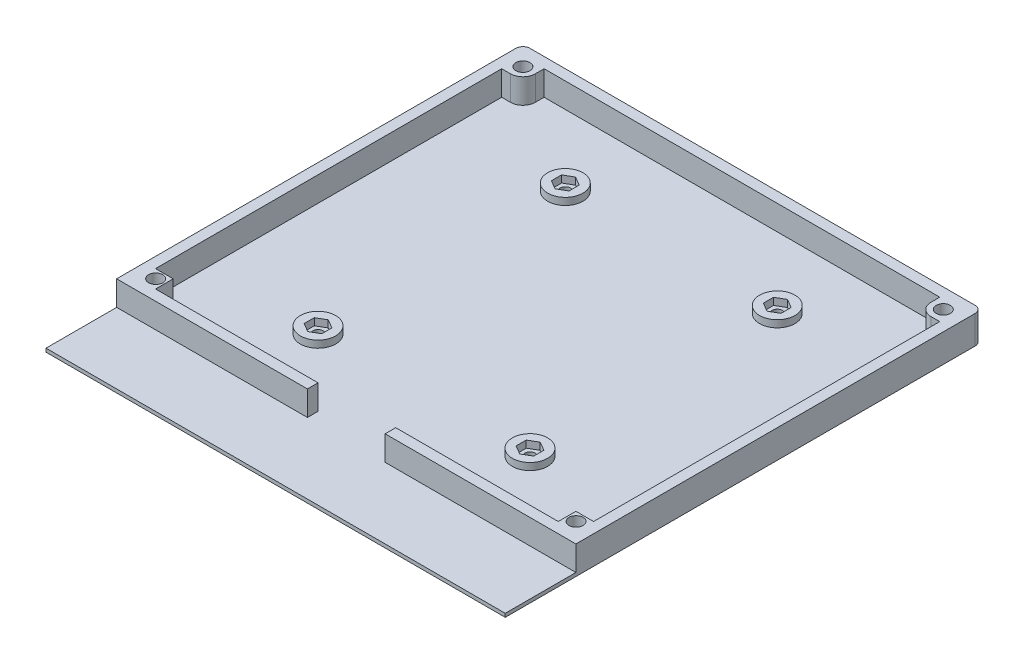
ISO-10303-21;
HEADER;
FILE_DESCRIPTION(('STEP AP214'),'2;1');
FILE_NAME('part.step','',(''),(''),'','','');
FILE_SCHEMA(('AUTOMOTIVE_DESIGN { 1 0 10303 214 1 1 1 1 }'));
ENDSEC;
DATA;
#1=APPLICATION_CONTEXT('core data for automotive mechanical design processes');
#2=APPLICATION_PROTOCOL_DEFINITION('international standard','automotive_design',2000,#1);
#3=PRODUCT_CONTEXT('',#1,'mechanical');
#4=PRODUCT('Part','Part','',(#3));
#5=PRODUCT_RELATED_PRODUCT_CATEGORY('part','',(#4));
#6=PRODUCT_DEFINITION_FORMATION('','',#4);
#7=PRODUCT_DEFINITION_CONTEXT('part definition',#1,'design');
#8=PRODUCT_DEFINITION('design','',#6,#7);
#9=PRODUCT_DEFINITION_SHAPE('','',#8);
#10=(LENGTH_UNIT() NAMED_UNIT(*) SI_UNIT(.MILLI.,.METRE.));
#11=(NAMED_UNIT(*) PLANE_ANGLE_UNIT() SI_UNIT($,.RADIAN.));
#12=(NAMED_UNIT(*) SI_UNIT($,.STERADIAN.) SOLID_ANGLE_UNIT());
#13=UNCERTAINTY_MEASURE_WITH_UNIT(LENGTH_MEASURE(1.E-05),#10,'distance_accuracy_value','');
#14=(GEOMETRIC_REPRESENTATION_CONTEXT(3) GLOBAL_UNCERTAINTY_ASSIGNED_CONTEXT((#13)) GLOBAL_UNIT_ASSIGNED_CONTEXT((#10,
#11,#12)) REPRESENTATION_CONTEXT('',''));
#15=CARTESIAN_POINT('',(0.,0.,0.));
#16=DIRECTION('',(0.,0.,1.));
#17=DIRECTION('',(1.,0.,0.));
#18=AXIS2_PLACEMENT_3D('',#15,#16,#17);
#19=CARTESIAN_POINT('',(0.,0.,0.));
#20=DIRECTION('',(0.,1.,0.));
#21=DIRECTION('',(0.,0.,1.));
#22=AXIS2_PLACEMENT_3D('',#19,#20,#21);
#23=PLANE('',#22);
#24=CARTESIAN_POINT('',(30.,0.,25.4999999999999));
#25=DIRECTION('',(0.,1.,0.));
#26=DIRECTION('',(0.,0.,1.));
#27=AXIS2_PLACEMENT_3D('',#24,#25,#26);
#28=CIRCLE('',#27,4.99999999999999);
#29=CARTESIAN_POINT('',(30.,0.,30.4999999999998));
#30=VERTEX_POINT('',#29);
#31=EDGE_CURVE('E378',#30,#30,#28,.T.);
#32=ORIENTED_EDGE('',*,*,#31,.F.);
#33=EDGE_LOOP('',(#32));
#34=FACE_BOUND('',#33,.T.);
#35=CARTESIAN_POINT('',(-30.,0.,25.4999999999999));
#36=DIRECTION('',(0.,1.,0.));
#37=DIRECTION('',(0.,0.,1.));
#38=AXIS2_PLACEMENT_3D('',#35,#36,#37);
#39=CIRCLE('',#38,5.00000000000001);
#40=CARTESIAN_POINT('',(-30.,0.,30.4999999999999));
#41=VERTEX_POINT('',#40);
#42=EDGE_CURVE('E423',#41,#41,#39,.T.);
#43=ORIENTED_EDGE('',*,*,#42,.F.);
#44=EDGE_LOOP('',(#43));
#45=FACE_BOUND('',#44,.T.);
#46=CARTESIAN_POINT('',(30.,0.,-44.5000000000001));
#47=DIRECTION('',(0.,1.,0.));
#48=DIRECTION('',(0.,0.,1.));
#49=AXIS2_PLACEMENT_3D('',#46,#47,#48);
#50=CIRCLE('',#49,4.99999999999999);
#51=CARTESIAN_POINT('',(30.,0.,-39.5000000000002));
#52=VERTEX_POINT('',#51);
#53=EDGE_CURVE('E477',#52,#52,#50,.T.);
#54=ORIENTED_EDGE('',*,*,#53,.F.);
#55=EDGE_LOOP('',(#54));
#56=FACE_BOUND('',#55,.T.);
#57=CARTESIAN_POINT('',(-30.,0.,-44.5000000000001));
#58=DIRECTION('',(0.,1.,0.));
#59=DIRECTION('',(0.,0.,1.));
#60=AXIS2_PLACEMENT_3D('',#57,#58,#59);
#61=CIRCLE('',#60,5.00000000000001);
#62=CARTESIAN_POINT('',(-30.,0.,-39.5000000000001));
#63=VERTEX_POINT('',#62);
#64=EDGE_CURVE('E531',#63,#63,#61,.T.);
#65=ORIENTED_EDGE('',*,*,#64,.F.);
#66=EDGE_LOOP('',(#65));
#67=FACE_BOUND('',#66,.T.);
#68=DIRECTION('',(0.,0.,1.));
#69=VECTOR('',#68,1.);
#70=CARTESIAN_POINT('',(-11.,0.,0.));
#71=LINE('',#70,#69);
#72=CARTESIAN_POINT('',(-11.,0.,44.4999999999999));
#73=VERTEX_POINT('',#72);
#74=CARTESIAN_POINT('',(-11.,0.,47.5));
#75=VERTEX_POINT('',#74);
#76=EDGE_CURVE('E682',#73,#75,#71,.T.);
#77=ORIENTED_EDGE('',*,*,#76,.T.);
#78=DIRECTION('',(-1.,0.,0.));
#79=VECTOR('',#78,1.);
#80=CARTESIAN_POINT('',(0.,0.,47.5));
#81=LINE('',#80,#79);
#82=CARTESIAN_POINT('',(-65.,0.,47.5));
#83=VERTEX_POINT('',#82);
#84=EDGE_CURVE('E680',#75,#83,#81,.T.);
#85=ORIENTED_EDGE('',*,*,#84,.T.);
#86=DIRECTION('',(0.,0.,-1.));
#87=VECTOR('',#86,1.);
#88=CARTESIAN_POINT('',(-65.,0.,0.));
#89=LINE('',#88,#87);
#90=CARTESIAN_POINT('',(-65.,0.,67.5));
#91=VERTEX_POINT('',#90);
#92=EDGE_CURVE('E750',#91,#83,#89,.T.);
#93=ORIENTED_EDGE('',*,*,#92,.F.);
#94=DIRECTION('',(-1.,0.,0.));
#95=VECTOR('',#94,1.);
#96=CARTESIAN_POINT('',(0.,0.,67.5));
#97=LINE('',#96,#95);
#98=CARTESIAN_POINT('',(65.0000000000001,0.,67.5));
#99=VERTEX_POINT('',#98);
#100=EDGE_CURVE('E768',#99,#91,#97,.T.);
#101=ORIENTED_EDGE('',*,*,#100,.F.);
#102=DIRECTION('',(0.,0.,1.));
#103=VECTOR('',#102,1.);
#104=CARTESIAN_POINT('',(65.0000000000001,0.,0.));
#105=LINE('',#104,#103);
#106=CARTESIAN_POINT('',(65.0000000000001,0.,47.4999999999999));
#107=VERTEX_POINT('',#106);
#108=EDGE_CURVE('E755',#107,#99,#105,.T.);
#109=ORIENTED_EDGE('',*,*,#108,.F.);
#110=DIRECTION('',(1.,0.,0.));
#111=VECTOR('',#110,1.);
#112=CARTESIAN_POINT('',(0.,0.,47.4999999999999));
#113=LINE('',#112,#111);
#114=CARTESIAN_POINT('',(11.,0.,47.4999999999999));
#115=VERTEX_POINT('',#114);
#116=EDGE_CURVE('E677',#115,#107,#113,.T.);
#117=ORIENTED_EDGE('',*,*,#116,.F.);
#118=DIRECTION('',(0.,0.,-1.));
#119=VECTOR('',#118,1.);
#120=CARTESIAN_POINT('',(11.,0.,0.));
#121=LINE('',#120,#119);
#122=CARTESIAN_POINT('',(11.,0.,44.4999999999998));
#123=VERTEX_POINT('',#122);
#124=EDGE_CURVE('E675',#115,#123,#121,.T.);
#125=ORIENTED_EDGE('',*,*,#124,.T.);
#126=DIRECTION('',(1.,0.,0.));
#127=VECTOR('',#126,1.);
#128=CARTESIAN_POINT('',(0.,0.,44.4999999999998));
#129=LINE('',#128,#127);
#130=CARTESIAN_POINT('',(57.0000000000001,0.,44.4999999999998));
#131=VERTEX_POINT('',#130);
#132=EDGE_CURVE('E673',#123,#131,#129,.T.);
#133=ORIENTED_EDGE('',*,*,#132,.T.);
#134=DIRECTION('',(0.,0.,-1.));
#135=VECTOR('',#134,1.);
#136=CARTESIAN_POINT('',(57.0000000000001,0.,0.));
#137=LINE('',#136,#135);
#138=CARTESIAN_POINT('',(57.0000000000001,0.,39.4999999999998));
#139=VERTEX_POINT('',#138);
#140=EDGE_CURVE('E671',#131,#139,#137,.T.);
#141=ORIENTED_EDGE('',*,*,#140,.T.);
#142=DIRECTION('',(1.,0.,0.));
#143=VECTOR('',#142,1.);
#144=CARTESIAN_POINT('',(0.,0.,39.4999999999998));
#145=LINE('',#144,#143);
#146=CARTESIAN_POINT('',(62.0000000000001,0.,39.4999999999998));
#147=VERTEX_POINT('',#146);
#148=EDGE_CURVE('E669',#139,#147,#145,.T.);
#149=ORIENTED_EDGE('',*,*,#148,.T.);
#150=DIRECTION('',(0.,0.,-1.));
#151=VECTOR('',#150,1.);
#152=CARTESIAN_POINT('',(62.0000000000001,0.,0.));
#153=LINE('',#152,#151);
#154=CARTESIAN_POINT('',(62.0000000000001,0.,-58.5000000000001));
#155=VERTEX_POINT('',#154);
#156=EDGE_CURVE('E667',#147,#155,#153,.T.);
#157=ORIENTED_EDGE('',*,*,#156,.T.);
#158=DIRECTION('',(1.,0.,0.));
#159=VECTOR('',#158,1.);
#160=CARTESIAN_POINT('',(0.,0.,-58.5000000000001));
#161=LINE('',#160,#159);
#162=CARTESIAN_POINT('',(59.4999999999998,0.,-58.5000000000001));
#163=VERTEX_POINT('',#162);
#164=EDGE_CURVE('E664',#163,#155,#161,.T.);
#165=ORIENTED_EDGE('',*,*,#164,.F.);
#166=CARTESIAN_POINT('',(59.4999999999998,0.,-62.0000000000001));
#167=DIRECTION('',(0.,1.,0.));
#168=DIRECTION('',(0.,0.,1.));
#169=AXIS2_PLACEMENT_3D('',#166,#167,#168);
#170=CIRCLE('',#169,3.5);
#171=CARTESIAN_POINT('',(55.9999999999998,0.,-62.0000000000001));
#172=VERTEX_POINT('',#171);
#173=EDGE_CURVE('E662',#163,#172,#170,.F.);
#174=ORIENTED_EDGE('',*,*,#173,.T.);
#175=DIRECTION('',(0.,0.,-1.));
#176=VECTOR('',#175,1.);
#177=CARTESIAN_POINT('',(55.9999999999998,0.,0.));
#178=LINE('',#177,#176);
#179=CARTESIAN_POINT('',(55.9999999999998,0.,-64.5000000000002));
#180=VERTEX_POINT('',#179);
#181=EDGE_CURVE('E660',#172,#180,#178,.T.);
#182=ORIENTED_EDGE('',*,*,#181,.T.);
#183=DIRECTION('',(-1.,0.,0.));
#184=VECTOR('',#183,1.);
#185=CARTESIAN_POINT('',(0.,0.,-64.5000000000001));
#186=LINE('',#185,#184);
#187=CARTESIAN_POINT('',(-55.9999999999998,0.,-64.5000000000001));
#188=VERTEX_POINT('',#187);
#189=EDGE_CURVE('E658',#180,#188,#186,.T.);
#190=ORIENTED_EDGE('',*,*,#189,.T.);
#191=DIRECTION('',(0.,0.,-1.));
#192=VECTOR('',#191,1.);
#193=CARTESIAN_POINT('',(-55.9999999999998,0.,0.));
#194=LINE('',#193,#192);
#195=CARTESIAN_POINT('',(-55.9999999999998,0.,-62.0000000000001));
#196=VERTEX_POINT('',#195);
#197=EDGE_CURVE('E655',#196,#188,#194,.T.);
#198=ORIENTED_EDGE('',*,*,#197,.F.);
#199=CARTESIAN_POINT('',(-59.4999999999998,0.,-62.0000000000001));
#200=DIRECTION('',(0.,1.,0.));
#201=DIRECTION('',(0.,0.,1.));
#202=AXIS2_PLACEMENT_3D('',#199,#200,#201);
#203=CIRCLE('',#202,3.5);
#204=CARTESIAN_POINT('',(-59.4999999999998,0.,-58.5000000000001));
#205=VERTEX_POINT('',#204);
#206=EDGE_CURVE('E652',#205,#196,#203,.T.);
#207=ORIENTED_EDGE('',*,*,#206,.F.);
#208=DIRECTION('',(-1.,0.,0.));
#209=VECTOR('',#208,1.);
#210=CARTESIAN_POINT('',(0.,0.,-58.5000000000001));
#211=LINE('',#210,#209);
#212=CARTESIAN_POINT('',(-62.,0.,-58.5000000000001));
#213=VERTEX_POINT('',#212);
#214=EDGE_CURVE('E580',#205,#213,#211,.T.);
#215=ORIENTED_EDGE('',*,*,#214,.T.);
#216=DIRECTION('',(0.,0.,1.));
#217=VECTOR('',#216,1.);
#218=CARTESIAN_POINT('',(-62.,0.,0.));
#219=LINE('',#218,#217);
#220=CARTESIAN_POINT('',(-62.,0.,39.4999999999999));
#221=VERTEX_POINT('',#220);
#222=EDGE_CURVE('E585',#213,#221,#219,.T.);
#223=ORIENTED_EDGE('',*,*,#222,.T.);
#224=DIRECTION('',(1.,0.,0.));
#225=VECTOR('',#224,1.);
#226=CARTESIAN_POINT('',(0.,0.,39.4999999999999));
#227=LINE('',#226,#225);
#228=CARTESIAN_POINT('',(-57.,0.,39.4999999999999));
#229=VERTEX_POINT('',#228);
#230=EDGE_CURVE('E688',#221,#229,#227,.T.);
#231=ORIENTED_EDGE('',*,*,#230,.T.);
#232=DIRECTION('',(0.,0.,1.));
#233=VECTOR('',#232,1.);
#234=CARTESIAN_POINT('',(-57.,0.,0.));
#235=LINE('',#234,#233);
#236=CARTESIAN_POINT('',(-57.,0.,44.4999999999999));
#237=VERTEX_POINT('',#236);
#238=EDGE_CURVE('E686',#229,#237,#235,.T.);
#239=ORIENTED_EDGE('',*,*,#238,.T.);
#240=DIRECTION('',(1.,0.,0.));
#241=VECTOR('',#240,1.);
#242=CARTESIAN_POINT('',(0.,0.,44.4999999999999));
#243=LINE('',#242,#241);
#244=EDGE_CURVE('E684',#237,#73,#243,.T.);
#245=ORIENTED_EDGE('',*,*,#244,.T.);
#246=EDGE_LOOP('',(#77,#85,#93,#101,#109,#117,#125,#133,#141,#149,#157,#165,#174,#182,#190,#198,
#207,#215,#223,#231,#239,#245));
#247=FACE_BOUND('',#246,.T.);
#248=ADVANCED_FACE('F39',(#34,#45,#56,#67,#247),#23,.T.);
#249=CARTESIAN_POINT('',(-63.0000000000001,-1.,-65.5));
#250=DIRECTION('',(0.,1.,0.));
#251=DIRECTION('',(0.,0.,1.));
#252=AXIS2_PLACEMENT_3D('',#249,#250,#251);
#253=CYLINDRICAL_SURFACE('',#252,2.);
#254=DIRECTION('',(0.,1.,0.));
#255=VECTOR('',#254,1.);
#256=CARTESIAN_POINT('',(-65.0000000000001,-1.,-65.5));
#257=LINE('',#256,#255);
#258=CARTESIAN_POINT('',(-65.0000000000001,-1.,-65.5));
#259=VERTEX_POINT('',#258);
#260=CARTESIAN_POINT('',(-65.0000000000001,7.,-65.5));
#261=VERTEX_POINT('',#260);
#262=EDGE_CURVE('E765',#259,#261,#257,.T.);
#263=ORIENTED_EDGE('',*,*,#262,.T.);
#264=CARTESIAN_POINT('',(-63.0000000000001,7.,-65.5));
#265=DIRECTION('',(0.,1.,0.));
#266=DIRECTION('',(0.,0.,1.));
#267=AXIS2_PLACEMENT_3D('',#264,#265,#266);
#268=CIRCLE('',#267,2.);
#269=CARTESIAN_POINT('',(-63.0000000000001,7.,-67.5));
#270=VERTEX_POINT('',#269);
#271=EDGE_CURVE('E626',#261,#270,#268,.F.);
#272=ORIENTED_EDGE('',*,*,#271,.T.);
#273=DIRECTION('',(0.,1.,0.));
#274=VECTOR('',#273,1.);
#275=CARTESIAN_POINT('',(-63.0000000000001,-1.,-67.5));
#276=LINE('',#275,#274);
#277=CARTESIAN_POINT('',(-63.0000000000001,-1.,-67.5));
#278=VERTEX_POINT('',#277);
#279=EDGE_CURVE('E11',#278,#270,#276,.T.);
#280=ORIENTED_EDGE('',*,*,#279,.F.);
#281=CARTESIAN_POINT('',(-63.0000000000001,-1.,-65.5));
#282=DIRECTION('',(0.,1.,0.));
#283=DIRECTION('',(0.,0.,1.));
#284=AXIS2_PLACEMENT_3D('',#281,#282,#283);
#285=CIRCLE('',#284,2.);
#286=EDGE_CURVE('E751',#259,#278,#285,.F.);
#287=ORIENTED_EDGE('',*,*,#286,.F.);
#288=EDGE_LOOP('',(#263,#272,#280,#287));
#289=FACE_BOUND('',#288,.T.);
#290=ADVANCED_FACE('F41',(#289),#253,.T.);
#291=CARTESIAN_POINT('',(0.,-1.,-67.5));
#292=DIRECTION('',(0.,0.,1.));
#293=DIRECTION('',(1.,0.,0.));
#294=AXIS2_PLACEMENT_3D('',#291,#292,#293);
#295=PLANE('',#294);
#296=ORIENTED_EDGE('',*,*,#279,.T.);
#297=DIRECTION('',(1.,0.,0.));
#298=VECTOR('',#297,1.);
#299=CARTESIAN_POINT('',(0.,7.,-67.5));
#300=LINE('',#299,#298);
#301=CARTESIAN_POINT('',(63.0000000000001,7.,-67.5));
#302=VERTEX_POINT('',#301);
#303=EDGE_CURVE('E623',#270,#302,#300,.T.);
#304=ORIENTED_EDGE('',*,*,#303,.T.);
#305=DIRECTION('',(0.,1.,0.));
#306=VECTOR('',#305,1.);
#307=CARTESIAN_POINT('',(63.0000000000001,-1.,-67.5));
#308=LINE('',#307,#306);
#309=CARTESIAN_POINT('',(63.0000000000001,-1.,-67.5));
#310=VERTEX_POINT('',#309);
#311=EDGE_CURVE('E48',#310,#302,#308,.T.);
#312=ORIENTED_EDGE('',*,*,#311,.F.);
#313=DIRECTION('',(1.,0.,0.));
#314=VECTOR('',#313,1.);
#315=CARTESIAN_POINT('',(0.,-1.,-67.5));
#316=LINE('',#315,#314);
#317=EDGE_CURVE('E763',#278,#310,#316,.T.);
#318=ORIENTED_EDGE('',*,*,#317,.F.);
#319=EDGE_LOOP('',(#296,#304,#312,#318));
#320=FACE_BOUND('',#319,.T.);
#321=ADVANCED_FACE('F885',(#320),#295,.F.);
#322=CARTESIAN_POINT('',(63.0000000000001,-1.,-65.5));
#323=DIRECTION('',(0.,1.,0.));
#324=DIRECTION('',(0.,0.,1.));
#325=AXIS2_PLACEMENT_3D('',#322,#323,#324);
#326=CYLINDRICAL_SURFACE('',#325,2.);
#327=ORIENTED_EDGE('',*,*,#311,.T.);
#328=CARTESIAN_POINT('',(63.0000000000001,7.,-65.5));
#329=DIRECTION('',(0.,1.,0.));
#330=DIRECTION('',(0.,0.,1.));
#331=AXIS2_PLACEMENT_3D('',#328,#329,#330);
#332=CIRCLE('',#331,2.);
#333=CARTESIAN_POINT('',(65.0000000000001,7.,-65.5));
#334=VERTEX_POINT('',#333);
#335=EDGE_CURVE('E620',#302,#334,#332,.F.);
#336=ORIENTED_EDGE('',*,*,#335,.T.);
#337=DIRECTION('',(0.,1.,0.));
#338=VECTOR('',#337,1.);
#339=CARTESIAN_POINT('',(65.0000000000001,-1.,-65.5));
#340=LINE('',#339,#338);
#341=CARTESIAN_POINT('',(65.0000000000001,-1.,-65.5));
#342=VERTEX_POINT('',#341);
#343=EDGE_CURVE('E772',#342,#334,#340,.T.);
#344=ORIENTED_EDGE('',*,*,#343,.F.);
#345=CARTESIAN_POINT('',(63.0000000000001,-1.,-65.5));
#346=DIRECTION('',(0.,1.,0.));
#347=DIRECTION('',(0.,0.,1.));
#348=AXIS2_PLACEMENT_3D('',#345,#346,#347);
#349=CIRCLE('',#348,2.);
#350=EDGE_CURVE('E761',#310,#342,#349,.F.);
#351=ORIENTED_EDGE('',*,*,#350,.F.);
#352=EDGE_LOOP('',(#327,#336,#344,#351));
#353=FACE_BOUND('',#352,.T.);
#354=ADVANCED_FACE('F880',(#353),#326,.T.);
#355=CARTESIAN_POINT('',(65.0000000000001,-1.,0.));
#356=DIRECTION('',(-1.,0.,0.));
#357=DIRECTION('',(0.,0.,1.));
#358=AXIS2_PLACEMENT_3D('',#355,#356,#357);
#359=PLANE('',#358);
#360=ORIENTED_EDGE('',*,*,#343,.T.);
#361=DIRECTION('',(0.,0.,1.));
#362=VECTOR('',#361,1.);
#363=CARTESIAN_POINT('',(65.0000000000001,7.,0.));
#364=LINE('',#363,#362);
#365=CARTESIAN_POINT('',(65.0000000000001,7.,47.4999999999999));
#366=VERTEX_POINT('',#365);
#367=EDGE_CURVE('E617',#334,#366,#364,.T.);
#368=ORIENTED_EDGE('',*,*,#367,.T.);
#369=DIRECTION('',(0.,-1.,0.));
#370=VECTOR('',#369,1.);
#371=CARTESIAN_POINT('',(65.0000000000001,7.,47.4999999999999));
#372=LINE('',#371,#370);
#373=EDGE_CURVE('E711',#366,#107,#372,.T.);
#374=ORIENTED_EDGE('',*,*,#373,.T.);
#375=ORIENTED_EDGE('',*,*,#108,.T.);
#376=DIRECTION('',(0.,1.,0.));
#377=VECTOR('',#376,1.);
#378=CARTESIAN_POINT('',(65.0000000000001,-1.,67.5));
#379=LINE('',#378,#377);
#380=CARTESIAN_POINT('',(65.0000000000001,-1.,67.5));
#381=VERTEX_POINT('',#380);
#382=EDGE_CURVE('E774',#381,#99,#379,.T.);
#383=ORIENTED_EDGE('',*,*,#382,.F.);
#384=DIRECTION('',(0.,0.,1.));
#385=VECTOR('',#384,1.);
#386=CARTESIAN_POINT('',(65.0000000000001,-1.,0.));
#387=LINE('',#386,#385);
#388=EDGE_CURVE('E759',#342,#381,#387,.T.);
#389=ORIENTED_EDGE('',*,*,#388,.F.);
#390=EDGE_LOOP('',(#360,#368,#374,#375,#383,#389));
#391=FACE_BOUND('',#390,.T.);
#392=ADVANCED_FACE('F1588',(#391),#359,.F.);
#393=CARTESIAN_POINT('',(0.,-1.,67.5));
#394=DIRECTION('',(0.,0.,-1.));
#395=DIRECTION('',(-1.,0.,0.));
#396=AXIS2_PLACEMENT_3D('',#393,#394,#395);
#397=PLANE('',#396);
#398=ORIENTED_EDGE('',*,*,#100,.T.);
#399=DIRECTION('',(0.,1.,0.));
#400=VECTOR('',#399,1.);
#401=CARTESIAN_POINT('',(-65.,-1.,67.5));
#402=LINE('',#401,#400);
#403=CARTESIAN_POINT('',(-65.,-1.,67.5));
#404=VERTEX_POINT('',#403);
#405=EDGE_CURVE('E777',#404,#91,#402,.T.);
#406=ORIENTED_EDGE('',*,*,#405,.F.);
#407=DIRECTION('',(-1.,0.,0.));
#408=VECTOR('',#407,1.);
#409=CARTESIAN_POINT('',(0.,-1.,67.5));
#410=LINE('',#409,#408);
#411=EDGE_CURVE('E757',#381,#404,#410,.T.);
#412=ORIENTED_EDGE('',*,*,#411,.F.);
#413=ORIENTED_EDGE('',*,*,#382,.T.);
#414=EDGE_LOOP('',(#398,#406,#412,#413));
#415=FACE_BOUND('',#414,.T.);
#416=ADVANCED_FACE('F1585',(#415),#397,.F.);
#417=CARTESIAN_POINT('',(-65.,-1.,0.));
#418=DIRECTION('',(1.,0.,0.));
#419=DIRECTION('',(0.,0.,-1.));
#420=AXIS2_PLACEMENT_3D('',#417,#418,#419);
#421=PLANE('',#420);
#422=ORIENTED_EDGE('',*,*,#92,.T.);
#423=DIRECTION('',(0.,-1.,0.));
#424=VECTOR('',#423,1.);
#425=CARTESIAN_POINT('',(-65.,7.,47.5));
#426=LINE('',#425,#424);
#427=CARTESIAN_POINT('',(-65.,7.,47.5));
#428=VERTEX_POINT('',#427);
#429=EDGE_CURVE('E708',#428,#83,#426,.T.);
#430=ORIENTED_EDGE('',*,*,#429,.F.);
#431=DIRECTION('',(0.,0.,-1.));
#432=VECTOR('',#431,1.);
#433=CARTESIAN_POINT('',(-65.,7.,0.));
#434=LINE('',#433,#432);
#435=EDGE_CURVE('E629',#428,#261,#434,.T.);
#436=ORIENTED_EDGE('',*,*,#435,.T.);
#437=ORIENTED_EDGE('',*,*,#262,.F.);
#438=DIRECTION('',(0.,0.,-1.));
#439=VECTOR('',#438,1.);
#440=CARTESIAN_POINT('',(-65.,-1.,0.));
#441=LINE('',#440,#439);
#442=EDGE_CURVE('E754',#404,#259,#441,.T.);
#443=ORIENTED_EDGE('',*,*,#442,.F.);
#444=ORIENTED_EDGE('',*,*,#405,.T.);
#445=EDGE_LOOP('',(#422,#430,#436,#437,#443,#444));
#446=FACE_BOUND('',#445,.T.);
#447=ADVANCED_FACE('F894',(#446),#421,.F.);
#448=CARTESIAN_POINT('',(0.,-1.,0.));
#449=DIRECTION('',(0.,1.,0.));
#450=DIRECTION('',(0.,0.,1.));
#451=AXIS2_PLACEMENT_3D('',#448,#449,#450);
#452=PLANE('',#451);
#453=CARTESIAN_POINT('',(30.,-1.,-44.5000000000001));
#454=DIRECTION('',(0.,1.,0.));
#455=DIRECTION('',(0.,0.,1.));
#456=AXIS2_PLACEMENT_3D('',#453,#454,#455);
#457=CIRCLE('',#456,1.49999999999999);
#458=CARTESIAN_POINT('',(30.,-1.,-43.0000000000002));
#459=VERTEX_POINT('',#458);
#460=EDGE_CURVE('E1573',#459,#459,#457,.T.);
#461=ORIENTED_EDGE('',*,*,#460,.T.);
#462=EDGE_LOOP('',(#461));
#463=FACE_BOUND('',#462,.T.);
#464=CARTESIAN_POINT('',(59.4999999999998,-1.,41.9625423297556));
#465=DIRECTION('',(0.,1.,0.));
#466=DIRECTION('',(0.,0.,1.));
#467=AXIS2_PLACEMENT_3D('',#464,#465,#466);
#468=CIRCLE('',#467,2.);
#469=CARTESIAN_POINT('',(59.4999999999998,-1.,43.9625423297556));
#470=VERTEX_POINT('',#469);
#471=EDGE_CURVE('E1568',#470,#470,#468,.T.);
#472=ORIENTED_EDGE('',*,*,#471,.T.);
#473=EDGE_LOOP('',(#472));
#474=FACE_BOUND('',#473,.T.);
#475=CARTESIAN_POINT('',(-59.4999999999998,-1.,41.9625423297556));
#476=DIRECTION('',(0.,1.,0.));
#477=DIRECTION('',(0.,0.,1.));
#478=AXIS2_PLACEMENT_3D('',#475,#476,#477);
#479=CIRCLE('',#478,2.);
#480=CARTESIAN_POINT('',(-59.4999999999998,-1.,43.9625423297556));
#481=VERTEX_POINT('',#480);
#482=EDGE_CURVE('E1565',#481,#481,#479,.T.);
#483=ORIENTED_EDGE('',*,*,#482,.T.);
#484=EDGE_LOOP('',(#483));
#485=FACE_BOUND('',#484,.T.);
#486=CARTESIAN_POINT('',(59.4999999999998,-1.,-62.0000000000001));
#487=DIRECTION('',(0.,1.,0.));
#488=DIRECTION('',(0.,0.,1.));
#489=AXIS2_PLACEMENT_3D('',#486,#487,#488);
#490=CIRCLE('',#489,2.);
#491=CARTESIAN_POINT('',(59.4999999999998,-1.,-60.0000000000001));
#492=VERTEX_POINT('',#491);
#493=EDGE_CURVE('E1567',#492,#492,#490,.T.);
#494=ORIENTED_EDGE('',*,*,#493,.T.);
#495=EDGE_LOOP('',(#494));
#496=FACE_BOUND('',#495,.T.);
#497=CARTESIAN_POINT('',(-30.,-1.,25.4999999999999));
#498=DIRECTION('',(0.,1.,0.));
#499=DIRECTION('',(0.,0.,1.));
#500=AXIS2_PLACEMENT_3D('',#497,#498,#499);
#501=CIRCLE('',#500,1.5);
#502=CARTESIAN_POINT('',(-30.,-1.,26.9999999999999));
#503=VERTEX_POINT('',#502);
#504=EDGE_CURVE('E1663',#503,#503,#501,.T.);
#505=ORIENTED_EDGE('',*,*,#504,.T.);
#506=EDGE_LOOP('',(#505));
#507=FACE_BOUND('',#506,.T.);
#508=CARTESIAN_POINT('',(30.,-1.,25.4999999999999));
#509=DIRECTION('',(0.,1.,0.));
#510=DIRECTION('',(0.,0.,1.));
#511=AXIS2_PLACEMENT_3D('',#508,#509,#510);
#512=CIRCLE('',#511,1.49999999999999);
#513=CARTESIAN_POINT('',(30.,-1.,26.9999999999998));
#514=VERTEX_POINT('',#513);
#515=EDGE_CURVE('E1668',#514,#514,#512,.T.);
#516=ORIENTED_EDGE('',*,*,#515,.T.);
#517=EDGE_LOOP('',(#516));
#518=FACE_BOUND('',#517,.T.);
#519=CARTESIAN_POINT('',(-30.,-1.,-44.5000000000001));
#520=DIRECTION('',(0.,1.,0.));
#521=DIRECTION('',(0.,0.,1.));
#522=AXIS2_PLACEMENT_3D('',#519,#520,#521);
#523=CIRCLE('',#522,1.5);
#524=CARTESIAN_POINT('',(-30.,-1.,-43.0000000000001));
#525=VERTEX_POINT('',#524);
#526=EDGE_CURVE('E1665',#525,#525,#523,.T.);
#527=ORIENTED_EDGE('',*,*,#526,.T.);
#528=EDGE_LOOP('',(#527));
#529=FACE_BOUND('',#528,.T.);
#530=CARTESIAN_POINT('',(-59.4999999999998,-1.,-62.0000000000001));
#531=DIRECTION('',(0.,1.,0.));
#532=DIRECTION('',(0.,0.,1.));
#533=AXIS2_PLACEMENT_3D('',#530,#531,#532);
#534=CIRCLE('',#533,2.);
#535=CARTESIAN_POINT('',(-59.4999999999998,-1.,-60.0000000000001));
#536=VERTEX_POINT('',#535);
#537=EDGE_CURVE('E785',#536,#536,#534,.T.);
#538=ORIENTED_EDGE('',*,*,#537,.T.);
#539=EDGE_LOOP('',(#538));
#540=FACE_BOUND('',#539,.T.);
#541=ORIENTED_EDGE('',*,*,#286,.T.);
#542=ORIENTED_EDGE('',*,*,#317,.T.);
#543=ORIENTED_EDGE('',*,*,#350,.T.);
#544=ORIENTED_EDGE('',*,*,#388,.T.);
#545=ORIENTED_EDGE('',*,*,#411,.T.);
#546=ORIENTED_EDGE('',*,*,#442,.T.);
#547=EDGE_LOOP('',(#541,#542,#543,#544,#545,#546));
#548=FACE_BOUND('',#547,.T.);
#549=ADVANCED_FACE('F1377',(#463,#474,#485,#496,#507,#518,#529,#540,#548),#452,.F.);
#550=CARTESIAN_POINT('',(0.,7.,-58.5000000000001));
#551=DIRECTION('',(0.,0.,1.));
#552=DIRECTION('',(1.,0.,0.));
#553=AXIS2_PLACEMENT_3D('',#550,#551,#552);
#554=PLANE('',#553);
#555=ORIENTED_EDGE('',*,*,#214,.F.);
#556=DIRECTION('',(0.,-1.,0.));
#557=VECTOR('',#556,1.);
#558=CARTESIAN_POINT('',(-59.4999999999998,7.,-58.5000000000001));
#559=LINE('',#558,#557);
#560=CARTESIAN_POINT('',(-59.4999999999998,7.,-58.5000000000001));
#561=VERTEX_POINT('',#560);
#562=EDGE_CURVE('E747',#561,#205,#559,.T.);
#563=ORIENTED_EDGE('',*,*,#562,.F.);
#564=DIRECTION('',(-1.,0.,0.));
#565=VECTOR('',#564,1.);
#566=CARTESIAN_POINT('',(0.,7.,-58.5000000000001));
#567=LINE('',#566,#565);
#568=CARTESIAN_POINT('',(-62.,7.,-58.5000000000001));
#569=VERTEX_POINT('',#568);
#570=EDGE_CURVE('E581',#561,#569,#567,.T.);
#571=ORIENTED_EDGE('',*,*,#570,.T.);
#572=DIRECTION('',(0.,-1.,0.));
#573=VECTOR('',#572,1.);
#574=CARTESIAN_POINT('',(-62.,7.,-58.5000000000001));
#575=LINE('',#574,#573);
#576=EDGE_CURVE('E650',#569,#213,#575,.T.);
#577=ORIENTED_EDGE('',*,*,#576,.T.);
#578=EDGE_LOOP('',(#555,#563,#571,#577));
#579=FACE_BOUND('',#578,.T.);
#580=ADVANCED_FACE('F827',(#579),#554,.T.);
#581=CARTESIAN_POINT('',(-59.4999999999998,7.,-62.0000000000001));
#582=DIRECTION('',(0.,-1.,0.));
#583=DIRECTION('',(0.,0.,-1.));
#584=AXIS2_PLACEMENT_3D('',#581,#582,#583);
#585=CYLINDRICAL_SURFACE('',#584,3.5);
#586=ORIENTED_EDGE('',*,*,#206,.T.);
#587=DIRECTION('',(0.,-1.,0.));
#588=VECTOR('',#587,1.);
#589=CARTESIAN_POINT('',(-55.9999999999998,7.,-62.0000000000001));
#590=LINE('',#589,#588);
#591=CARTESIAN_POINT('',(-55.9999999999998,7.,-62.0000000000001));
#592=VERTEX_POINT('',#591);
#593=EDGE_CURVE('E744',#592,#196,#590,.T.);
#594=ORIENTED_EDGE('',*,*,#593,.F.);
#595=CARTESIAN_POINT('',(-59.4999999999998,7.,-62.0000000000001));
#596=DIRECTION('',(0.,1.,0.));
#597=DIRECTION('',(0.,0.,1.));
#598=AXIS2_PLACEMENT_3D('',#595,#596,#597);
#599=CIRCLE('',#598,3.5);
#600=EDGE_CURVE('E584',#561,#592,#599,.T.);
#601=ORIENTED_EDGE('',*,*,#600,.F.);
#602=ORIENTED_EDGE('',*,*,#562,.T.);
#603=EDGE_LOOP('',(#586,#594,#601,#602));
#604=FACE_BOUND('',#603,.T.);
#605=ADVANCED_FACE('F830',(#604),#585,.T.);
#606=CARTESIAN_POINT('',(-55.9999999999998,7.,0.));
#607=DIRECTION('',(-1.,0.,0.));
#608=DIRECTION('',(0.,0.,1.));
#609=AXIS2_PLACEMENT_3D('',#606,#607,#608);
#610=PLANE('',#609);
#611=ORIENTED_EDGE('',*,*,#197,.T.);
#612=DIRECTION('',(0.,-1.,0.));
#613=VECTOR('',#612,1.);
#614=CARTESIAN_POINT('',(-55.9999999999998,7.,-64.5000000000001));
#615=LINE('',#614,#613);
#616=CARTESIAN_POINT('',(-55.9999999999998,7.,-64.5000000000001));
#617=VERTEX_POINT('',#616);
#618=EDGE_CURVE('E741',#617,#188,#615,.T.);
#619=ORIENTED_EDGE('',*,*,#618,.F.);
#620=DIRECTION('',(0.,0.,-1.));
#621=VECTOR('',#620,1.);
#622=CARTESIAN_POINT('',(-55.9999999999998,7.,0.));
#623=LINE('',#622,#621);
#624=EDGE_CURVE('E587',#592,#617,#623,.T.);
#625=ORIENTED_EDGE('',*,*,#624,.F.);
#626=ORIENTED_EDGE('',*,*,#593,.T.);
#627=EDGE_LOOP('',(#611,#619,#625,#626));
#628=FACE_BOUND('',#627,.T.);
#629=ADVANCED_FACE('F834',(#628),#610,.F.);
#630=CARTESIAN_POINT('',(0.,7.,-64.5000000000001));
#631=DIRECTION('',(0.,0.,1.));
#632=DIRECTION('',(1.,0.,0.));
#633=AXIS2_PLACEMENT_3D('',#630,#631,#632);
#634=PLANE('',#633);
#635=ORIENTED_EDGE('',*,*,#189,.F.);
#636=DIRECTION('',(0.,-1.,0.));
#637=VECTOR('',#636,1.);
#638=CARTESIAN_POINT('',(55.9999999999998,7.,-64.5000000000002));
#639=LINE('',#638,#637);
#640=CARTESIAN_POINT('',(55.9999999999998,7.,-64.5000000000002));
#641=VERTEX_POINT('',#640);
#642=EDGE_CURVE('E738',#641,#180,#639,.T.);
#643=ORIENTED_EDGE('',*,*,#642,.F.);
#644=DIRECTION('',(-1.,0.,0.));
#645=VECTOR('',#644,1.);
#646=CARTESIAN_POINT('',(0.,7.,-64.5000000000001));
#647=LINE('',#646,#645);
#648=EDGE_CURVE('E589',#641,#617,#647,.T.);
#649=ORIENTED_EDGE('',*,*,#648,.T.);
#650=ORIENTED_EDGE('',*,*,#618,.T.);
#651=EDGE_LOOP('',(#635,#643,#649,#650));
#652=FACE_BOUND('',#651,.T.);
#653=ADVANCED_FACE('F916',(#652),#634,.T.);
#654=CARTESIAN_POINT('',(55.9999999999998,7.,0.));
#655=DIRECTION('',(-1.,0.,0.));
#656=DIRECTION('',(0.,0.,1.));
#657=AXIS2_PLACEMENT_3D('',#654,#655,#656);
#658=PLANE('',#657);
#659=ORIENTED_EDGE('',*,*,#181,.F.);
#660=DIRECTION('',(0.,-1.,0.));
#661=VECTOR('',#660,1.);
#662=CARTESIAN_POINT('',(55.9999999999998,7.,-62.0000000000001));
#663=LINE('',#662,#661);
#664=CARTESIAN_POINT('',(55.9999999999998,7.,-62.0000000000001));
#665=VERTEX_POINT('',#664);
#666=EDGE_CURVE('E735',#665,#172,#663,.T.);
#667=ORIENTED_EDGE('',*,*,#666,.F.);
#668=DIRECTION('',(0.,0.,-1.));
#669=VECTOR('',#668,1.);
#670=CARTESIAN_POINT('',(55.9999999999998,7.,0.));
#671=LINE('',#670,#669);
#672=EDGE_CURVE('E592',#665,#641,#671,.T.);
#673=ORIENTED_EDGE('',*,*,#672,.T.);
#674=ORIENTED_EDGE('',*,*,#642,.T.);
#675=EDGE_LOOP('',(#659,#667,#673,#674));
#676=FACE_BOUND('',#675,.T.);
#677=ADVANCED_FACE('F841',(#676),#658,.T.);
#678=CARTESIAN_POINT('',(59.4999999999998,7.,-62.0000000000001));
#679=DIRECTION('',(0.,-1.,0.));
#680=DIRECTION('',(0.,0.,-1.));
#681=AXIS2_PLACEMENT_3D('',#678,#679,#680);
#682=CYLINDRICAL_SURFACE('',#681,3.5);
#683=ORIENTED_EDGE('',*,*,#173,.F.);
#684=DIRECTION('',(0.,-1.,0.));
#685=VECTOR('',#684,1.);
#686=CARTESIAN_POINT('',(59.4999999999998,7.,-58.5000000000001));
#687=LINE('',#686,#685);
#688=CARTESIAN_POINT('',(59.4999999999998,7.,-58.5000000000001));
#689=VERTEX_POINT('',#688);
#690=EDGE_CURVE('E732',#689,#163,#687,.T.);
#691=ORIENTED_EDGE('',*,*,#690,.F.);
#692=CARTESIAN_POINT('',(59.4999999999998,7.,-62.0000000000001));
#693=DIRECTION('',(0.,1.,0.));
#694=DIRECTION('',(0.,0.,1.));
#695=AXIS2_PLACEMENT_3D('',#692,#693,#694);
#696=CIRCLE('',#695,3.5);
#697=EDGE_CURVE('E595',#689,#665,#696,.F.);
#698=ORIENTED_EDGE('',*,*,#697,.T.);
#699=ORIENTED_EDGE('',*,*,#666,.T.);
#700=EDGE_LOOP('',(#683,#691,#698,#699));
#701=FACE_BOUND('',#700,.T.);
#702=ADVANCED_FACE('F845',(#701),#682,.T.);
#703=CARTESIAN_POINT('',(0.,7.,-58.5000000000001));
#704=DIRECTION('',(0.,0.,-1.));
#705=DIRECTION('',(-1.,0.,0.));
#706=AXIS2_PLACEMENT_3D('',#703,#704,#705);
#707=PLANE('',#706);
#708=ORIENTED_EDGE('',*,*,#164,.T.);
#709=DIRECTION('',(0.,-1.,0.));
#710=VECTOR('',#709,1.);
#711=CARTESIAN_POINT('',(62.0000000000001,7.,-58.5000000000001));
#712=LINE('',#711,#710);
#713=CARTESIAN_POINT('',(62.0000000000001,7.,-58.5000000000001));
#714=VERTEX_POINT('',#713);
#715=EDGE_CURVE('E729',#714,#155,#712,.T.);
#716=ORIENTED_EDGE('',*,*,#715,.F.);
#717=DIRECTION('',(1.,0.,0.));
#718=VECTOR('',#717,1.);
#719=CARTESIAN_POINT('',(0.,7.,-58.5000000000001));
#720=LINE('',#719,#718);
#721=EDGE_CURVE('E598',#689,#714,#720,.T.);
#722=ORIENTED_EDGE('',*,*,#721,.F.);
#723=ORIENTED_EDGE('',*,*,#690,.T.);
#724=EDGE_LOOP('',(#708,#716,#722,#723));
#725=FACE_BOUND('',#724,.T.);
#726=ADVANCED_FACE('F851',(#725),#707,.F.);
#727=CARTESIAN_POINT('',(62.0000000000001,7.,0.));
#728=DIRECTION('',(-1.,0.,0.));
#729=DIRECTION('',(0.,0.,1.));
#730=AXIS2_PLACEMENT_3D('',#727,#728,#729);
#731=PLANE('',#730);
#732=ORIENTED_EDGE('',*,*,#156,.F.);
#733=DIRECTION('',(0.,-1.,0.));
#734=VECTOR('',#733,1.);
#735=CARTESIAN_POINT('',(62.0000000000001,7.,39.4999999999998));
#736=LINE('',#735,#734);
#737=CARTESIAN_POINT('',(62.0000000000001,7.,39.4999999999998));
#738=VERTEX_POINT('',#737);
#739=EDGE_CURVE('E726',#738,#147,#736,.T.);
#740=ORIENTED_EDGE('',*,*,#739,.F.);
#741=DIRECTION('',(0.,0.,-1.));
#742=VECTOR('',#741,1.);
#743=CARTESIAN_POINT('',(62.0000000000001,7.,0.));
#744=LINE('',#743,#742);
#745=EDGE_CURVE('E600',#738,#714,#744,.T.);
#746=ORIENTED_EDGE('',*,*,#745,.T.);
#747=ORIENTED_EDGE('',*,*,#715,.T.);
#748=EDGE_LOOP('',(#732,#740,#746,#747));
#749=FACE_BOUND('',#748,.T.);
#750=ADVANCED_FACE('F854',(#749),#731,.T.);
#751=CARTESIAN_POINT('',(0.,7.,39.4999999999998));
#752=DIRECTION('',(0.,0.,-1.));
#753=DIRECTION('',(-1.,0.,0.));
#754=AXIS2_PLACEMENT_3D('',#751,#752,#753);
#755=PLANE('',#754);
#756=ORIENTED_EDGE('',*,*,#148,.F.);
#757=DIRECTION('',(0.,-1.,0.));
#758=VECTOR('',#757,1.);
#759=CARTESIAN_POINT('',(57.0000000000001,7.,39.4999999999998));
#760=LINE('',#759,#758);
#761=CARTESIAN_POINT('',(57.0000000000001,7.,39.4999999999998));
#762=VERTEX_POINT('',#761);
#763=EDGE_CURVE('E723',#762,#139,#760,.T.);
#764=ORIENTED_EDGE('',*,*,#763,.F.);
#765=DIRECTION('',(1.,0.,0.));
#766=VECTOR('',#765,1.);
#767=CARTESIAN_POINT('',(0.,7.,39.4999999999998));
#768=LINE('',#767,#766);
#769=EDGE_CURVE('E603',#762,#738,#768,.T.);
#770=ORIENTED_EDGE('',*,*,#769,.T.);
#771=ORIENTED_EDGE('',*,*,#739,.T.);
#772=EDGE_LOOP('',(#756,#764,#770,#771));
#773=FACE_BOUND('',#772,.T.);
#774=ADVANCED_FACE('F857',(#773),#755,.T.);
#775=CARTESIAN_POINT('',(57.0000000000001,7.,0.));
#776=DIRECTION('',(-1.,0.,0.));
#777=DIRECTION('',(0.,0.,1.));
#778=AXIS2_PLACEMENT_3D('',#775,#776,#777);
#779=PLANE('',#778);
#780=ORIENTED_EDGE('',*,*,#140,.F.);
#781=DIRECTION('',(0.,-1.,0.));
#782=VECTOR('',#781,1.);
#783=CARTESIAN_POINT('',(57.0000000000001,7.,44.4999999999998));
#784=LINE('',#783,#782);
#785=CARTESIAN_POINT('',(57.0000000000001,7.,44.4999999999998));
#786=VERTEX_POINT('',#785);
#787=EDGE_CURVE('E720',#786,#131,#784,.T.);
#788=ORIENTED_EDGE('',*,*,#787,.F.);
#789=DIRECTION('',(0.,0.,-1.));
#790=VECTOR('',#789,1.);
#791=CARTESIAN_POINT('',(57.0000000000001,7.,0.));
#792=LINE('',#791,#790);
#793=EDGE_CURVE('E606',#786,#762,#792,.T.);
#794=ORIENTED_EDGE('',*,*,#793,.T.);
#795=ORIENTED_EDGE('',*,*,#763,.T.);
#796=EDGE_LOOP('',(#780,#788,#794,#795));
#797=FACE_BOUND('',#796,.T.);
#798=ADVANCED_FACE('F862',(#797),#779,.T.);
#799=CARTESIAN_POINT('',(0.,7.,44.4999999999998));
#800=DIRECTION('',(0.,0.,-1.));
#801=DIRECTION('',(-1.,0.,0.));
#802=AXIS2_PLACEMENT_3D('',#799,#800,#801);
#803=PLANE('',#802);
#804=ORIENTED_EDGE('',*,*,#132,.F.);
#805=DIRECTION('',(0.,-1.,0.));
#806=VECTOR('',#805,1.);
#807=CARTESIAN_POINT('',(11.,7.,44.4999999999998));
#808=LINE('',#807,#806);
#809=CARTESIAN_POINT('',(11.,7.,44.4999999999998));
#810=VERTEX_POINT('',#809);
#811=EDGE_CURVE('E717',#810,#123,#808,.T.);
#812=ORIENTED_EDGE('',*,*,#811,.F.);
#813=DIRECTION('',(1.,0.,0.));
#814=VECTOR('',#813,1.);
#815=CARTESIAN_POINT('',(0.,7.,44.4999999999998));
#816=LINE('',#815,#814);
#817=EDGE_CURVE('E609',#810,#786,#816,.T.);
#818=ORIENTED_EDGE('',*,*,#817,.T.);
#819=ORIENTED_EDGE('',*,*,#787,.T.);
#820=EDGE_LOOP('',(#804,#812,#818,#819));
#821=FACE_BOUND('',#820,.T.);
#822=ADVANCED_FACE('F865',(#821),#803,.T.);
#823=CARTESIAN_POINT('',(11.,7.,0.));
#824=DIRECTION('',(-1.,0.,0.));
#825=DIRECTION('',(0.,0.,1.));
#826=AXIS2_PLACEMENT_3D('',#823,#824,#825);
#827=PLANE('',#826);
#828=ORIENTED_EDGE('',*,*,#124,.F.);
#829=DIRECTION('',(0.,-1.,0.));
#830=VECTOR('',#829,1.);
#831=CARTESIAN_POINT('',(11.,7.,47.4999999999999));
#832=LINE('',#831,#830);
#833=CARTESIAN_POINT('',(11.,7.,47.4999999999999));
#834=VERTEX_POINT('',#833);
#835=EDGE_CURVE('E714',#834,#115,#832,.T.);
#836=ORIENTED_EDGE('',*,*,#835,.F.);
#837=DIRECTION('',(0.,0.,-1.));
#838=VECTOR('',#837,1.);
#839=CARTESIAN_POINT('',(11.,7.,0.));
#840=LINE('',#839,#838);
#841=EDGE_CURVE('E612',#834,#810,#840,.T.);
#842=ORIENTED_EDGE('',*,*,#841,.T.);
#843=ORIENTED_EDGE('',*,*,#811,.T.);
#844=EDGE_LOOP('',(#828,#836,#842,#843));
#845=FACE_BOUND('',#844,.T.);
#846=ADVANCED_FACE('F869',(#845),#827,.T.);
#847=CARTESIAN_POINT('',(0.,7.,47.4999999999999));
#848=DIRECTION('',(0.,0.,-1.));
#849=DIRECTION('',(-1.,0.,0.));
#850=AXIS2_PLACEMENT_3D('',#847,#848,#849);
#851=PLANE('',#850);
#852=ORIENTED_EDGE('',*,*,#116,.T.);
#853=ORIENTED_EDGE('',*,*,#373,.F.);
#854=DIRECTION('',(1.,0.,0.));
#855=VECTOR('',#854,1.);
#856=CARTESIAN_POINT('',(0.,7.,47.4999999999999));
#857=LINE('',#856,#855);
#858=EDGE_CURVE('E615',#834,#366,#857,.T.);
#859=ORIENTED_EDGE('',*,*,#858,.F.);
#860=ORIENTED_EDGE('',*,*,#835,.T.);
#861=EDGE_LOOP('',(#852,#853,#859,#860));
#862=FACE_BOUND('',#861,.T.);
#863=ADVANCED_FACE('F873',(#862),#851,.F.);
#864=CARTESIAN_POINT('',(0.,7.,47.5));
#865=DIRECTION('',(0.,0.,1.));
#866=DIRECTION('',(1.,0.,0.));
#867=AXIS2_PLACEMENT_3D('',#864,#865,#866);
#868=PLANE('',#867);
#869=ORIENTED_EDGE('',*,*,#84,.F.);
#870=DIRECTION('',(0.,-1.,0.));
#871=VECTOR('',#870,1.);
#872=CARTESIAN_POINT('',(-11.,7.,47.5));
#873=LINE('',#872,#871);
#874=CARTESIAN_POINT('',(-11.,7.,47.5));
#875=VERTEX_POINT('',#874);
#876=EDGE_CURVE('E705',#875,#75,#873,.T.);
#877=ORIENTED_EDGE('',*,*,#876,.F.);
#878=DIRECTION('',(-1.,0.,0.));
#879=VECTOR('',#878,1.);
#880=CARTESIAN_POINT('',(0.,7.,47.5));
#881=LINE('',#880,#879);
#882=EDGE_CURVE('E632',#875,#428,#881,.T.);
#883=ORIENTED_EDGE('',*,*,#882,.T.);
#884=ORIENTED_EDGE('',*,*,#429,.T.);
#885=EDGE_LOOP('',(#869,#877,#883,#884));
#886=FACE_BOUND('',#885,.T.);
#887=ADVANCED_FACE('F899',(#886),#868,.T.);
#888=CARTESIAN_POINT('',(-11.,7.,0.));
#889=DIRECTION('',(1.,0.,0.));
#890=DIRECTION('',(0.,0.,-1.));
#891=AXIS2_PLACEMENT_3D('',#888,#889,#890);
#892=PLANE('',#891);
#893=ORIENTED_EDGE('',*,*,#76,.F.);
#894=DIRECTION('',(0.,-1.,0.));
#895=VECTOR('',#894,1.);
#896=CARTESIAN_POINT('',(-11.,7.,44.4999999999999));
#897=LINE('',#896,#895);
#898=CARTESIAN_POINT('',(-11.,7.,44.4999999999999));
#899=VERTEX_POINT('',#898);
#900=EDGE_CURVE('E702',#899,#73,#897,.T.);
#901=ORIENTED_EDGE('',*,*,#900,.F.);
#902=DIRECTION('',(0.,0.,1.));
#903=VECTOR('',#902,1.);
#904=CARTESIAN_POINT('',(-11.,7.,0.));
#905=LINE('',#904,#903);
#906=EDGE_CURVE('E635',#899,#875,#905,.T.);
#907=ORIENTED_EDGE('',*,*,#906,.T.);
#908=ORIENTED_EDGE('',*,*,#876,.T.);
#909=EDGE_LOOP('',(#893,#901,#907,#908));
#910=FACE_BOUND('',#909,.T.);
#911=ADVANCED_FACE('F902',(#910),#892,.T.);
#912=CARTESIAN_POINT('',(0.,7.,44.4999999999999));
#913=DIRECTION('',(0.,0.,-1.));
#914=DIRECTION('',(-1.,0.,0.));
#915=AXIS2_PLACEMENT_3D('',#912,#913,#914);
#916=PLANE('',#915);
#917=ORIENTED_EDGE('',*,*,#244,.F.);
#918=DIRECTION('',(0.,-1.,0.));
#919=VECTOR('',#918,1.);
#920=CARTESIAN_POINT('',(-57.,7.,44.4999999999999));
#921=LINE('',#920,#919);
#922=CARTESIAN_POINT('',(-57.,7.,44.4999999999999));
#923=VERTEX_POINT('',#922);
#924=EDGE_CURVE('E699',#923,#237,#921,.T.);
#925=ORIENTED_EDGE('',*,*,#924,.F.);
#926=DIRECTION('',(1.,0.,0.));
#927=VECTOR('',#926,1.);
#928=CARTESIAN_POINT('',(0.,7.,44.4999999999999));
#929=LINE('',#928,#927);
#930=EDGE_CURVE('E638',#923,#899,#929,.T.);
#931=ORIENTED_EDGE('',*,*,#930,.T.);
#932=ORIENTED_EDGE('',*,*,#900,.T.);
#933=EDGE_LOOP('',(#917,#925,#931,#932));
#934=FACE_BOUND('',#933,.T.);
#935=ADVANCED_FACE('F907',(#934),#916,.T.);
#936=CARTESIAN_POINT('',(-57.,7.,0.));
#937=DIRECTION('',(1.,0.,0.));
#938=DIRECTION('',(0.,0.,-1.));
#939=AXIS2_PLACEMENT_3D('',#936,#937,#938);
#940=PLANE('',#939);
#941=ORIENTED_EDGE('',*,*,#238,.F.);
#942=DIRECTION('',(0.,-1.,0.));
#943=VECTOR('',#942,1.);
#944=CARTESIAN_POINT('',(-57.,7.,39.4999999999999));
#945=LINE('',#944,#943);
#946=CARTESIAN_POINT('',(-57.,7.,39.4999999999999));
#947=VERTEX_POINT('',#946);
#948=EDGE_CURVE('E696',#947,#229,#945,.T.);
#949=ORIENTED_EDGE('',*,*,#948,.F.);
#950=DIRECTION('',(0.,0.,1.));
#951=VECTOR('',#950,1.);
#952=CARTESIAN_POINT('',(-57.,7.,0.));
#953=LINE('',#952,#951);
#954=EDGE_CURVE('E641',#947,#923,#953,.T.);
#955=ORIENTED_EDGE('',*,*,#954,.T.);
#956=ORIENTED_EDGE('',*,*,#924,.T.);
#957=EDGE_LOOP('',(#941,#949,#955,#956));
#958=FACE_BOUND('',#957,.T.);
#959=ADVANCED_FACE('F910',(#958),#940,.T.);
#960=CARTESIAN_POINT('',(0.,7.,39.4999999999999));
#961=DIRECTION('',(0.,0.,-1.));
#962=DIRECTION('',(-1.,0.,0.));
#963=AXIS2_PLACEMENT_3D('',#960,#961,#962);
#964=PLANE('',#963);
#965=ORIENTED_EDGE('',*,*,#230,.F.);
#966=DIRECTION('',(0.,-1.,0.));
#967=VECTOR('',#966,1.);
#968=CARTESIAN_POINT('',(-62.,7.,39.4999999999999));
#969=LINE('',#968,#967);
#970=CARTESIAN_POINT('',(-62.,7.,39.4999999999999));
#971=VERTEX_POINT('',#970);
#972=EDGE_CURVE('E693',#971,#221,#969,.T.);
#973=ORIENTED_EDGE('',*,*,#972,.F.);
#974=DIRECTION('',(1.,0.,0.));
#975=VECTOR('',#974,1.);
#976=CARTESIAN_POINT('',(0.,7.,39.4999999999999));
#977=LINE('',#976,#975);
#978=EDGE_CURVE('E644',#971,#947,#977,.T.);
#979=ORIENTED_EDGE('',*,*,#978,.T.);
#980=ORIENTED_EDGE('',*,*,#948,.T.);
#981=EDGE_LOOP('',(#965,#973,#979,#980));
#982=FACE_BOUND('',#981,.T.);
#983=ADVANCED_FACE('F913',(#982),#964,.T.);
#984=CARTESIAN_POINT('',(-62.,7.,0.));
#985=DIRECTION('',(1.,0.,0.));
#986=DIRECTION('',(0.,0.,-1.));
#987=AXIS2_PLACEMENT_3D('',#984,#985,#986);
#988=PLANE('',#987);
#989=ORIENTED_EDGE('',*,*,#222,.F.);
#990=ORIENTED_EDGE('',*,*,#576,.F.);
#991=DIRECTION('',(0.,0.,1.));
#992=VECTOR('',#991,1.);
#993=CARTESIAN_POINT('',(-62.,7.,0.));
#994=LINE('',#993,#992);
#995=EDGE_CURVE('E647',#569,#971,#994,.T.);
#996=ORIENTED_EDGE('',*,*,#995,.T.);
#997=ORIENTED_EDGE('',*,*,#972,.T.);
#998=EDGE_LOOP('',(#989,#990,#996,#997));
#999=FACE_BOUND('',#998,.T.);
#1000=ADVANCED_FACE('F813',(#999),#988,.T.);
#1001=CARTESIAN_POINT('',(0.,7.,0.));
#1002=DIRECTION('',(0.,1.,0.));
#1003=DIRECTION('',(0.,0.,1.));
#1004=AXIS2_PLACEMENT_3D('',#1001,#1002,#1003);
#1005=PLANE('',#1004);
#1006=CARTESIAN_POINT('',(59.4999999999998,7.,41.9625423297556));
#1007=DIRECTION('',(0.,1.,0.));
#1008=DIRECTION('',(0.,0.,1.));
#1009=AXIS2_PLACEMENT_3D('',#1006,#1007,#1008);
#1010=CIRCLE('',#1009,2.);
#1011=CARTESIAN_POINT('',(59.4999999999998,7.,43.9625423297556));
#1012=VERTEX_POINT('',#1011);
#1013=EDGE_CURVE('E43',#1012,#1012,#1010,.T.);
#1014=ORIENTED_EDGE('',*,*,#1013,.F.);
#1015=EDGE_LOOP('',(#1014));
#1016=FACE_BOUND('',#1015,.T.);
#1017=CARTESIAN_POINT('',(-59.4999999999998,7.,41.9625423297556));
#1018=DIRECTION('',(0.,1.,0.));
#1019=DIRECTION('',(0.,0.,1.));
#1020=AXIS2_PLACEMENT_3D('',#1017,#1018,#1019);
#1021=CIRCLE('',#1020,2.);
#1022=CARTESIAN_POINT('',(-59.4999999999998,7.,43.9625423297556));
#1023=VERTEX_POINT('',#1022);
#1024=EDGE_CURVE('E799',#1023,#1023,#1021,.T.);
#1025=ORIENTED_EDGE('',*,*,#1024,.F.);
#1026=EDGE_LOOP('',(#1025));
#1027=FACE_BOUND('',#1026,.T.);
#1028=CARTESIAN_POINT('',(59.4999999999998,7.,-62.0000000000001));
#1029=DIRECTION('',(0.,1.,0.));
#1030=DIRECTION('',(0.,0.,1.));
#1031=AXIS2_PLACEMENT_3D('',#1028,#1029,#1030);
#1032=CIRCLE('',#1031,2.);
#1033=CARTESIAN_POINT('',(59.4999999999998,7.,-60.0000000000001));
#1034=VERTEX_POINT('',#1033);
#1035=EDGE_CURVE('E797',#1034,#1034,#1032,.T.);
#1036=ORIENTED_EDGE('',*,*,#1035,.F.);
#1037=EDGE_LOOP('',(#1036));
#1038=FACE_BOUND('',#1037,.T.);
#1039=CARTESIAN_POINT('',(-59.4999999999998,7.,-62.0000000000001));
#1040=DIRECTION('',(0.,1.,0.));
#1041=DIRECTION('',(0.,0.,1.));
#1042=AXIS2_PLACEMENT_3D('',#1039,#1040,#1041);
#1043=CIRCLE('',#1042,2.);
#1044=CARTESIAN_POINT('',(-59.4999999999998,7.,-60.0000000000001));
#1045=VERTEX_POINT('',#1044);
#1046=EDGE_CURVE('E794',#1045,#1045,#1043,.T.);
#1047=ORIENTED_EDGE('',*,*,#1046,.F.);
#1048=EDGE_LOOP('',(#1047));
#1049=FACE_BOUND('',#1048,.T.);
#1050=ORIENTED_EDGE('',*,*,#570,.F.);
#1051=ORIENTED_EDGE('',*,*,#600,.T.);
#1052=ORIENTED_EDGE('',*,*,#624,.T.);
#1053=ORIENTED_EDGE('',*,*,#648,.F.);
#1054=ORIENTED_EDGE('',*,*,#672,.F.);
#1055=ORIENTED_EDGE('',*,*,#697,.F.);
#1056=ORIENTED_EDGE('',*,*,#721,.T.);
#1057=ORIENTED_EDGE('',*,*,#745,.F.);
#1058=ORIENTED_EDGE('',*,*,#769,.F.);
#1059=ORIENTED_EDGE('',*,*,#793,.F.);
#1060=ORIENTED_EDGE('',*,*,#817,.F.);
#1061=ORIENTED_EDGE('',*,*,#841,.F.);
#1062=ORIENTED_EDGE('',*,*,#858,.T.);
#1063=ORIENTED_EDGE('',*,*,#367,.F.);
#1064=ORIENTED_EDGE('',*,*,#335,.F.);
#1065=ORIENTED_EDGE('',*,*,#303,.F.);
#1066=ORIENTED_EDGE('',*,*,#271,.F.);
#1067=ORIENTED_EDGE('',*,*,#435,.F.);
#1068=ORIENTED_EDGE('',*,*,#882,.F.);
#1069=ORIENTED_EDGE('',*,*,#906,.F.);
#1070=ORIENTED_EDGE('',*,*,#930,.F.);
#1071=ORIENTED_EDGE('',*,*,#954,.F.);
#1072=ORIENTED_EDGE('',*,*,#978,.F.);
#1073=ORIENTED_EDGE('',*,*,#995,.F.);
#1074=EDGE_LOOP('',(#1050,#1051,#1052,#1053,#1054,#1055,#1056,#1057,#1058,#1059,#1060,#1061,
#1062,#1063,#1064,#1065,#1066,#1067,#1068,#1069,#1070,#1071,#1072,#1073));
#1075=FACE_BOUND('',#1074,.T.);
#1076=ADVANCED_FACE('F809',(#1016,#1027,#1038,#1049,#1075),#1005,.T.);
#1077=CARTESIAN_POINT('',(10.5190652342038,2.,-18.2195554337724));
#1078=DIRECTION('',(0.500000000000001,0.,-0.866025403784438));
#1079=DIRECTION('',(-0.866025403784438,0.,-0.500000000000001));
#1080=AXIS2_PLACEMENT_3D('',#1077,#1078,#1079);
#1081=PLANE('',#1080);
#1082=DIRECTION('',(0.866025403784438,0.,0.500000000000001));
#1083=VECTOR('',#1082,1.);
#1084=CARTESIAN_POINT('',(10.5190652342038,0.,-18.2195554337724));
#1085=LINE('',#1084,#1083);
#1086=CARTESIAN_POINT('',(-32.5,0.,-43.0566243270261));
#1087=VERTEX_POINT('',#1086);
#1088=CARTESIAN_POINT('',(-30.,0.,-41.613248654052));
#1089=VERTEX_POINT('',#1088);
#1090=EDGE_CURVE('E526',#1087,#1089,#1085,.T.);
#1091=ORIENTED_EDGE('',*,*,#1090,.F.);
#1092=DIRECTION('',(0.,-1.,0.));
#1093=VECTOR('',#1092,1.);
#1094=CARTESIAN_POINT('',(-32.5,2.,-43.0566243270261));
#1095=LINE('',#1094,#1093);
#1096=CARTESIAN_POINT('',(-32.5,2.,-43.0566243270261));
#1097=VERTEX_POINT('',#1096);
#1098=EDGE_CURVE('E577',#1097,#1087,#1095,.T.);
#1099=ORIENTED_EDGE('',*,*,#1098,.F.);
#1100=DIRECTION('',(0.866025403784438,0.,0.500000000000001));
#1101=VECTOR('',#1100,1.);
#1102=CARTESIAN_POINT('',(10.5190652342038,2.,-18.2195554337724));
#1103=LINE('',#1102,#1101);
#1104=CARTESIAN_POINT('',(-30.,2.,-41.613248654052));
#1105=VERTEX_POINT('',#1104);
#1106=EDGE_CURVE('E527',#1097,#1105,#1103,.T.);
#1107=ORIENTED_EDGE('',*,*,#1106,.T.);
#1108=DIRECTION('',(0.,-1.,0.));
#1109=VECTOR('',#1108,1.);
#1110=CARTESIAN_POINT('',(-30.,2.,-41.613248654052));
#1111=LINE('',#1110,#1109);
#1112=EDGE_CURVE('E549',#1105,#1089,#1111,.T.);
#1113=ORIENTED_EDGE('',*,*,#1112,.T.);
#1114=EDGE_LOOP('',(#1091,#1099,#1107,#1113));
#1115=FACE_BOUND('',#1114,.T.);
#1116=ADVANCED_FACE('F812',(#1115),#1081,.T.);
#1117=CARTESIAN_POINT('',(-32.5,2.,0.));
#1118=DIRECTION('',(1.,0.,0.));
#1119=DIRECTION('',(0.,0.,-1.));
#1120=AXIS2_PLACEMENT_3D('',#1117,#1118,#1119);
#1121=PLANE('',#1120);
#1122=DIRECTION('',(0.,0.,1.));
#1123=VECTOR('',#1122,1.);
#1124=CARTESIAN_POINT('',(-32.5,0.,0.));
#1125=LINE('',#1124,#1123);
#1126=CARTESIAN_POINT('',(-32.5,0.,-45.9433756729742));
#1127=VERTEX_POINT('',#1126);
#1128=EDGE_CURVE('E551',#1127,#1087,#1125,.T.);
#1129=ORIENTED_EDGE('',*,*,#1128,.F.);
#1130=DIRECTION('',(0.,-1.,0.));
#1131=VECTOR('',#1130,1.);
#1132=CARTESIAN_POINT('',(-32.5,2.,-45.9433756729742));
#1133=LINE('',#1132,#1131);
#1134=CARTESIAN_POINT('',(-32.5,2.,-45.9433756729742));
#1135=VERTEX_POINT('',#1134);
#1136=EDGE_CURVE('E574',#1135,#1127,#1133,.T.);
#1137=ORIENTED_EDGE('',*,*,#1136,.F.);
#1138=DIRECTION('',(0.,0.,1.));
#1139=VECTOR('',#1138,1.);
#1140=CARTESIAN_POINT('',(-32.5,2.,0.));
#1141=LINE('',#1140,#1139);
#1142=EDGE_CURVE('E530',#1135,#1097,#1141,.T.);
#1143=ORIENTED_EDGE('',*,*,#1142,.T.);
#1144=ORIENTED_EDGE('',*,*,#1098,.T.);
#1145=EDGE_LOOP('',(#1129,#1137,#1143,#1144));
#1146=FACE_BOUND('',#1145,.T.);
#1147=ADVANCED_FACE('F1042',(#1146),#1121,.T.);
#1148=CARTESIAN_POINT('',(-28.0190652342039,2.,-48.5304445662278));
#1149=DIRECTION('',(0.500000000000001,0.,0.866025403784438));
#1150=DIRECTION('',(0.866025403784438,0.,-0.500000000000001));
#1151=AXIS2_PLACEMENT_3D('',#1148,#1149,#1150);
#1152=PLANE('',#1151);
#1153=DIRECTION('',(-0.866025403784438,0.,0.500000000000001));
#1154=VECTOR('',#1153,1.);
#1155=CARTESIAN_POINT('',(-28.0190652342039,0.,-48.5304445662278));
#1156=LINE('',#1155,#1154);
#1157=CARTESIAN_POINT('',(-30.,0.,-47.3867513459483));
#1158=VERTEX_POINT('',#1157);
#1159=EDGE_CURVE('E553',#1158,#1127,#1156,.T.);
#1160=ORIENTED_EDGE('',*,*,#1159,.F.);
#1161=DIRECTION('',(0.,-1.,0.));
#1162=VECTOR('',#1161,1.);
#1163=CARTESIAN_POINT('',(-30.,2.,-47.3867513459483));
#1164=LINE('',#1163,#1162);
#1165=CARTESIAN_POINT('',(-30.,2.,-47.3867513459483));
#1166=VERTEX_POINT('',#1165);
#1167=EDGE_CURVE('E571',#1166,#1158,#1164,.T.);
#1168=ORIENTED_EDGE('',*,*,#1167,.F.);
#1169=DIRECTION('',(-0.866025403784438,0.,0.500000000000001));
#1170=VECTOR('',#1169,1.);
#1171=CARTESIAN_POINT('',(-28.0190652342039,2.,-48.5304445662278));
#1172=LINE('',#1171,#1170);
#1173=EDGE_CURVE('E534',#1166,#1135,#1172,.T.);
#1174=ORIENTED_EDGE('',*,*,#1173,.T.);
#1175=ORIENTED_EDGE('',*,*,#1136,.T.);
#1176=EDGE_LOOP('',(#1160,#1168,#1174,#1175));
#1177=FACE_BOUND('',#1176,.T.);
#1178=ADVANCED_FACE('F1038',(#1177),#1152,.T.);
#1179=CARTESIAN_POINT('',(13.0190652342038,2.,-22.5496824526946));
#1180=DIRECTION('',(-0.500000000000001,0.,0.866025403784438));
#1181=DIRECTION('',(0.866025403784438,0.,0.500000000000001));
#1182=AXIS2_PLACEMENT_3D('',#1179,#1180,#1181);
#1183=PLANE('',#1182);
#1184=DIRECTION('',(-0.866025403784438,0.,-0.500000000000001));
#1185=VECTOR('',#1184,1.);
#1186=CARTESIAN_POINT('',(13.0190652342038,0.,-22.5496824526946));
#1187=LINE('',#1186,#1185);
#1188=CARTESIAN_POINT('',(-27.5,0.,-45.9433756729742));
#1189=VERTEX_POINT('',#1188);
#1190=EDGE_CURVE('E555',#1189,#1158,#1187,.T.);
#1191=ORIENTED_EDGE('',*,*,#1190,.F.);
#1192=DIRECTION('',(0.,-1.,0.));
#1193=VECTOR('',#1192,1.);
#1194=CARTESIAN_POINT('',(-27.5,2.,-45.9433756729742));
#1195=LINE('',#1194,#1193);
#1196=CARTESIAN_POINT('',(-27.5,2.,-45.9433756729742));
#1197=VERTEX_POINT('',#1196);
#1198=EDGE_CURVE('E568',#1197,#1189,#1195,.T.);
#1199=ORIENTED_EDGE('',*,*,#1198,.F.);
#1200=DIRECTION('',(-0.866025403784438,0.,-0.500000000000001));
#1201=VECTOR('',#1200,1.);
#1202=CARTESIAN_POINT('',(13.0190652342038,2.,-22.5496824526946));
#1203=LINE('',#1202,#1201);
#1204=EDGE_CURVE('E537',#1197,#1166,#1203,.T.);
#1205=ORIENTED_EDGE('',*,*,#1204,.T.);
#1206=ORIENTED_EDGE('',*,*,#1167,.T.);
#1207=EDGE_LOOP('',(#1191,#1199,#1205,#1206));
#1208=FACE_BOUND('',#1207,.T.);
#1209=ADVANCED_FACE('F1034',(#1208),#1183,.T.);
#1210=CARTESIAN_POINT('',(-27.5,2.,0.));
#1211=DIRECTION('',(-1.,0.,0.));
#1212=DIRECTION('',(0.,0.,1.));
#1213=AXIS2_PLACEMENT_3D('',#1210,#1211,#1212);
#1214=PLANE('',#1213);
#1215=DIRECTION('',(0.,0.,-1.));
#1216=VECTOR('',#1215,1.);
#1217=CARTESIAN_POINT('',(-27.5,0.,0.));
#1218=LINE('',#1217,#1216);
#1219=CARTESIAN_POINT('',(-27.5,0.,-43.0566243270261));
#1220=VERTEX_POINT('',#1219);
#1221=EDGE_CURVE('E557',#1220,#1189,#1218,.T.);
#1222=ORIENTED_EDGE('',*,*,#1221,.F.);
#1223=DIRECTION('',(0.,-1.,0.));
#1224=VECTOR('',#1223,1.);
#1225=CARTESIAN_POINT('',(-27.5,2.,-43.0566243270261));
#1226=LINE('',#1225,#1224);
#1227=CARTESIAN_POINT('',(-27.5,2.,-43.0566243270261));
#1228=VERTEX_POINT('',#1227);
#1229=EDGE_CURVE('E565',#1228,#1220,#1226,.T.);
#1230=ORIENTED_EDGE('',*,*,#1229,.F.);
#1231=DIRECTION('',(0.,0.,-1.));
#1232=VECTOR('',#1231,1.);
#1233=CARTESIAN_POINT('',(-27.5,2.,0.));
#1234=LINE('',#1233,#1232);
#1235=EDGE_CURVE('E540',#1228,#1197,#1234,.T.);
#1236=ORIENTED_EDGE('',*,*,#1235,.T.);
#1237=ORIENTED_EDGE('',*,*,#1198,.T.);
#1238=EDGE_LOOP('',(#1222,#1230,#1236,#1237));
#1239=FACE_BOUND('',#1238,.T.);
#1240=ADVANCED_FACE('F1027',(#1239),#1214,.T.);
#1241=CARTESIAN_POINT('',(-25.5190652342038,2.,-44.2003175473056));
#1242=DIRECTION('',(-0.499999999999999,0.,-0.866025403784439));
#1243=DIRECTION('',(-0.866025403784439,0.,0.499999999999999));
#1244=AXIS2_PLACEMENT_3D('',#1241,#1242,#1243);
#1245=PLANE('',#1244);
#1246=DIRECTION('',(0.866025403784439,0.,-0.499999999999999));
#1247=VECTOR('',#1246,1.);
#1248=CARTESIAN_POINT('',(-25.5190652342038,0.,-44.2003175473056));
#1249=LINE('',#1248,#1247);
#1250=EDGE_CURVE('E559',#1089,#1220,#1249,.T.);
#1251=ORIENTED_EDGE('',*,*,#1250,.F.);
#1252=ORIENTED_EDGE('',*,*,#1112,.F.);
#1253=DIRECTION('',(0.866025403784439,0.,-0.499999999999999));
#1254=VECTOR('',#1253,1.);
#1255=CARTESIAN_POINT('',(-25.5190652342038,2.,-44.2003175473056));
#1256=LINE('',#1255,#1254);
#1257=EDGE_CURVE('E543',#1105,#1228,#1256,.T.);
#1258=ORIENTED_EDGE('',*,*,#1257,.T.);
#1259=ORIENTED_EDGE('',*,*,#1229,.T.);
#1260=EDGE_LOOP('',(#1251,#1252,#1258,#1259));
#1261=FACE_BOUND('',#1260,.T.);
#1262=ADVANCED_FACE('F1021',(#1261),#1245,.T.);
#1263=CARTESIAN_POINT('',(-30.,2.,-44.5000000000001));
#1264=DIRECTION('',(0.,-1.,0.));
#1265=DIRECTION('',(0.,0.,-1.));
#1266=AXIS2_PLACEMENT_3D('',#1263,#1264,#1265);
#1267=CYLINDRICAL_SURFACE('',#1266,5.00000000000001);
#1268=CARTESIAN_POINT('',(-30.,2.,-44.5000000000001));
#1269=DIRECTION('',(0.,1.,0.));
#1270=DIRECTION('',(0.,0.,1.));
#1271=AXIS2_PLACEMENT_3D('',#1268,#1269,#1270);
#1272=CIRCLE('',#1271,5.00000000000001);
#1273=CARTESIAN_POINT('',(-30.,2.,-39.5000000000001));
#1274=VERTEX_POINT('',#1273);
#1275=EDGE_CURVE('E546',#1274,#1274,#1272,.T.);
#1276=ORIENTED_EDGE('',*,*,#1275,.F.);
#1277=EDGE_LOOP('',(#1276));
#1278=FACE_BOUND('',#1277,.T.);
#1279=ORIENTED_EDGE('',*,*,#64,.T.);
#1280=EDGE_LOOP('',(#1279));
#1281=FACE_BOUND('',#1280,.T.);
#1282=ADVANCED_FACE('F953',(#1278,#1281),#1267,.T.);
#1283=CARTESIAN_POINT('',(0.,2.,0.));
#1284=DIRECTION('',(0.,1.,0.));
#1285=DIRECTION('',(0.,0.,1.));
#1286=AXIS2_PLACEMENT_3D('',#1283,#1284,#1285);
#1287=PLANE('',#1286);
#1288=ORIENTED_EDGE('',*,*,#1106,.F.);
#1289=ORIENTED_EDGE('',*,*,#1142,.F.);
#1290=ORIENTED_EDGE('',*,*,#1173,.F.);
#1291=ORIENTED_EDGE('',*,*,#1204,.F.);
#1292=ORIENTED_EDGE('',*,*,#1235,.F.);
#1293=ORIENTED_EDGE('',*,*,#1257,.F.);
#1294=EDGE_LOOP('',(#1288,#1289,#1290,#1291,#1292,#1293));
#1295=FACE_BOUND('',#1294,.T.);
#1296=ORIENTED_EDGE('',*,*,#1275,.T.);
#1297=EDGE_LOOP('',(#1296));
#1298=FACE_BOUND('',#1297,.T.);
#1299=ADVANCED_FACE('F943',(#1295,#1298),#1287,.T.);
#1300=CARTESIAN_POINT('',(-30.,0.,-44.5000000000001));
#1301=DIRECTION('',(0.,1.,0.));
#1302=DIRECTION('',(0.,0.,1.));
#1303=AXIS2_PLACEMENT_3D('',#1300,#1301,#1302);
#1304=CIRCLE('',#1303,1.5);
#1305=CARTESIAN_POINT('',(-30.,0.,-43.0000000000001));
#1306=VERTEX_POINT('',#1305);
#1307=EDGE_CURVE('E791',#1306,#1306,#1304,.T.);
#1308=ORIENTED_EDGE('',*,*,#1307,.F.);
#1309=EDGE_LOOP('',(#1308));
#1310=FACE_BOUND('',#1309,.T.);
#1311=ORIENTED_EDGE('',*,*,#1090,.T.);
#1312=ORIENTED_EDGE('',*,*,#1250,.T.);
#1313=ORIENTED_EDGE('',*,*,#1221,.T.);
#1314=ORIENTED_EDGE('',*,*,#1190,.T.);
#1315=ORIENTED_EDGE('',*,*,#1159,.T.);
#1316=ORIENTED_EDGE('',*,*,#1128,.T.);
#1317=EDGE_LOOP('',(#1311,#1312,#1313,#1314,#1315,#1316));
#1318=FACE_BOUND('',#1317,.T.);
#1319=ADVANCED_FACE('F929',(#1310,#1318),#23,.T.);
#1320=CARTESIAN_POINT('',(25.5190652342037,2.,-44.2003175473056));
#1321=DIRECTION('',(0.499999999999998,0.,-0.86602540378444));
#1322=DIRECTION('',(-0.86602540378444,0.,-0.499999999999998));
#1323=AXIS2_PLACEMENT_3D('',#1320,#1321,#1322);
#1324=PLANE('',#1323);
#1325=DIRECTION('',(0.86602540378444,0.,0.499999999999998));
#1326=VECTOR('',#1325,1.);
#1327=CARTESIAN_POINT('',(25.5190652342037,0.,-44.2003175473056));
#1328=LINE('',#1327,#1326);
#1329=CARTESIAN_POINT('',(27.4999999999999,0.,-43.0566243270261));
#1330=VERTEX_POINT('',#1329);
#1331=CARTESIAN_POINT('',(30.,0.,-41.613248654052));
#1332=VERTEX_POINT('',#1331);
#1333=EDGE_CURVE('E472',#1330,#1332,#1328,.T.);
#1334=ORIENTED_EDGE('',*,*,#1333,.F.);
#1335=DIRECTION('',(0.,-1.,0.));
#1336=VECTOR('',#1335,1.);
#1337=CARTESIAN_POINT('',(27.4999999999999,2.,-43.0566243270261));
#1338=LINE('',#1337,#1336);
#1339=CARTESIAN_POINT('',(27.4999999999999,2.,-43.0566243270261));
#1340=VERTEX_POINT('',#1339);
#1341=EDGE_CURVE('E523',#1340,#1330,#1338,.T.);
#1342=ORIENTED_EDGE('',*,*,#1341,.F.);
#1343=DIRECTION('',(0.86602540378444,0.,0.499999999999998));
#1344=VECTOR('',#1343,1.);
#1345=CARTESIAN_POINT('',(25.5190652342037,2.,-44.2003175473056));
#1346=LINE('',#1345,#1344);
#1347=CARTESIAN_POINT('',(30.,2.,-41.613248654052));
#1348=VERTEX_POINT('',#1347);
#1349=EDGE_CURVE('E473',#1340,#1348,#1346,.T.);
#1350=ORIENTED_EDGE('',*,*,#1349,.T.);
#1351=DIRECTION('',(0.,-1.,0.));
#1352=VECTOR('',#1351,1.);
#1353=CARTESIAN_POINT('',(30.,2.,-41.613248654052));
#1354=LINE('',#1353,#1352);
#1355=EDGE_CURVE('E495',#1348,#1332,#1354,.T.);
#1356=ORIENTED_EDGE('',*,*,#1355,.T.);
#1357=EDGE_LOOP('',(#1334,#1342,#1350,#1356));
#1358=FACE_BOUND('',#1357,.T.);
#1359=ADVANCED_FACE('F942',(#1358),#1324,.T.);
#1360=CARTESIAN_POINT('',(27.4999999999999,2.,0.));
#1361=DIRECTION('',(1.,0.,0.));
#1362=DIRECTION('',(0.,0.,-1.));
#1363=AXIS2_PLACEMENT_3D('',#1360,#1361,#1362);
#1364=PLANE('',#1363);
#1365=DIRECTION('',(0.,0.,1.));
#1366=VECTOR('',#1365,1.);
#1367=CARTESIAN_POINT('',(27.4999999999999,0.,0.));
#1368=LINE('',#1367,#1366);
#1369=CARTESIAN_POINT('',(27.4999999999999,0.,-45.9433756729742));
#1370=VERTEX_POINT('',#1369);
#1371=EDGE_CURVE('E497',#1370,#1330,#1368,.T.);
#1372=ORIENTED_EDGE('',*,*,#1371,.F.);
#1373=DIRECTION('',(0.,-1.,0.));
#1374=VECTOR('',#1373,1.);
#1375=CARTESIAN_POINT('',(27.4999999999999,2.,-45.9433756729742));
#1376=LINE('',#1375,#1374);
#1377=CARTESIAN_POINT('',(27.4999999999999,2.,-45.9433756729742));
#1378=VERTEX_POINT('',#1377);
#1379=EDGE_CURVE('E520',#1378,#1370,#1376,.T.);
#1380=ORIENTED_EDGE('',*,*,#1379,.F.);
#1381=DIRECTION('',(0.,0.,1.));
#1382=VECTOR('',#1381,1.);
#1383=CARTESIAN_POINT('',(27.4999999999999,2.,0.));
#1384=LINE('',#1383,#1382);
#1385=EDGE_CURVE('E476',#1378,#1340,#1384,.T.);
#1386=ORIENTED_EDGE('',*,*,#1385,.T.);
#1387=ORIENTED_EDGE('',*,*,#1341,.T.);
#1388=EDGE_LOOP('',(#1372,#1380,#1386,#1387));
#1389=FACE_BOUND('',#1388,.T.);
#1390=ADVANCED_FACE('F950',(#1389),#1364,.T.);
#1391=CARTESIAN_POINT('',(-13.0190652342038,2.,-22.5496824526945));
#1392=DIRECTION('',(0.500000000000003,0.,0.866025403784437));
#1393=DIRECTION('',(0.866025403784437,0.,-0.500000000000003));
#1394=AXIS2_PLACEMENT_3D('',#1391,#1392,#1393);
#1395=PLANE('',#1394);
#1396=DIRECTION('',(-0.866025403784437,0.,0.500000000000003));
#1397=VECTOR('',#1396,1.);
#1398=CARTESIAN_POINT('',(-13.0190652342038,0.,-22.5496824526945));
#1399=LINE('',#1398,#1397);
#1400=CARTESIAN_POINT('',(29.9999999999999,0.,-47.3867513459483));
#1401=VERTEX_POINT('',#1400);
#1402=EDGE_CURVE('E499',#1401,#1370,#1399,.T.);
#1403=ORIENTED_EDGE('',*,*,#1402,.F.);
#1404=DIRECTION('',(0.,-1.,0.));
#1405=VECTOR('',#1404,1.);
#1406=CARTESIAN_POINT('',(29.9999999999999,2.,-47.3867513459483));
#1407=LINE('',#1406,#1405);
#1408=CARTESIAN_POINT('',(29.9999999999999,2.,-47.3867513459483));
#1409=VERTEX_POINT('',#1408);
#1410=EDGE_CURVE('E517',#1409,#1401,#1407,.T.);
#1411=ORIENTED_EDGE('',*,*,#1410,.F.);
#1412=DIRECTION('',(-0.866025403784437,0.,0.500000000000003));
#1413=VECTOR('',#1412,1.);
#1414=CARTESIAN_POINT('',(-13.0190652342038,2.,-22.5496824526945));
#1415=LINE('',#1414,#1413);
#1416=EDGE_CURVE('E480',#1409,#1378,#1415,.T.);
#1417=ORIENTED_EDGE('',*,*,#1416,.T.);
#1418=ORIENTED_EDGE('',*,*,#1379,.T.);
#1419=EDGE_LOOP('',(#1403,#1411,#1417,#1418));
#1420=FACE_BOUND('',#1419,.T.);
#1421=ADVANCED_FACE('F1187',(#1420),#1395,.T.);
#1422=CARTESIAN_POINT('',(28.0190652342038,2.,-48.5304445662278));
#1423=DIRECTION('',(-0.499999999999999,0.,0.866025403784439));
#1424=DIRECTION('',(0.866025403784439,0.,0.499999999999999));
#1425=AXIS2_PLACEMENT_3D('',#1422,#1423,#1424);
#1426=PLANE('',#1425);
#1427=DIRECTION('',(-0.866025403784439,0.,-0.499999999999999));
#1428=VECTOR('',#1427,1.);
#1429=CARTESIAN_POINT('',(28.0190652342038,0.,-48.5304445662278));
#1430=LINE('',#1429,#1428);
#1431=CARTESIAN_POINT('',(32.4999999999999,0.,-45.9433756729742));
#1432=VERTEX_POINT('',#1431);
#1433=EDGE_CURVE('E501',#1432,#1401,#1430,.T.);
#1434=ORIENTED_EDGE('',*,*,#1433,.F.);
#1435=DIRECTION('',(0.,-1.,0.));
#1436=VECTOR('',#1435,1.);
#1437=CARTESIAN_POINT('',(32.4999999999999,2.,-45.9433756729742));
#1438=LINE('',#1437,#1436);
#1439=CARTESIAN_POINT('',(32.4999999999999,2.,-45.9433756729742));
#1440=VERTEX_POINT('',#1439);
#1441=EDGE_CURVE('E514',#1440,#1432,#1438,.T.);
#1442=ORIENTED_EDGE('',*,*,#1441,.F.);
#1443=DIRECTION('',(-0.866025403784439,0.,-0.499999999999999));
#1444=VECTOR('',#1443,1.);
#1445=CARTESIAN_POINT('',(28.0190652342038,2.,-48.5304445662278));
#1446=LINE('',#1445,#1444);
#1447=EDGE_CURVE('E483',#1440,#1409,#1446,.T.);
#1448=ORIENTED_EDGE('',*,*,#1447,.T.);
#1449=ORIENTED_EDGE('',*,*,#1410,.T.);
#1450=EDGE_LOOP('',(#1434,#1442,#1448,#1449));
#1451=FACE_BOUND('',#1450,.T.);
#1452=ADVANCED_FACE('F1197',(#1451),#1426,.T.);
#1453=CARTESIAN_POINT('',(32.4999999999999,2.,0.));
#1454=DIRECTION('',(-1.,0.,0.));
#1455=DIRECTION('',(0.,0.,1.));
#1456=AXIS2_PLACEMENT_3D('',#1453,#1454,#1455);
#1457=PLANE('',#1456);
#1458=DIRECTION('',(0.,0.,-1.));
#1459=VECTOR('',#1458,1.);
#1460=CARTESIAN_POINT('',(32.4999999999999,0.,0.));
#1461=LINE('',#1460,#1459);
#1462=CARTESIAN_POINT('',(32.4999999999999,0.,-43.056624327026));
#1463=VERTEX_POINT('',#1462);
#1464=EDGE_CURVE('E503',#1463,#1432,#1461,.T.);
#1465=ORIENTED_EDGE('',*,*,#1464,.F.);
#1466=DIRECTION('',(0.,-1.,0.));
#1467=VECTOR('',#1466,1.);
#1468=CARTESIAN_POINT('',(32.4999999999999,2.,-43.056624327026));
#1469=LINE('',#1468,#1467);
#1470=CARTESIAN_POINT('',(32.4999999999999,2.,-43.056624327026));
#1471=VERTEX_POINT('',#1470);
#1472=EDGE_CURVE('E511',#1471,#1463,#1469,.T.);
#1473=ORIENTED_EDGE('',*,*,#1472,.F.);
#1474=DIRECTION('',(0.,0.,-1.));
#1475=VECTOR('',#1474,1.);
#1476=CARTESIAN_POINT('',(32.4999999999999,2.,0.));
#1477=LINE('',#1476,#1475);
#1478=EDGE_CURVE('E486',#1471,#1440,#1477,.T.);
#1479=ORIENTED_EDGE('',*,*,#1478,.T.);
#1480=ORIENTED_EDGE('',*,*,#1441,.T.);
#1481=EDGE_LOOP('',(#1465,#1473,#1479,#1480));
#1482=FACE_BOUND('',#1481,.T.);
#1483=ADVANCED_FACE('F1207',(#1482),#1457,.T.);
#1484=CARTESIAN_POINT('',(-10.5190652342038,2.,-18.2195554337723));
#1485=DIRECTION('',(-0.500000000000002,0.,-0.866025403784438));
#1486=DIRECTION('',(-0.866025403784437,0.,0.500000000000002));
#1487=AXIS2_PLACEMENT_3D('',#1484,#1485,#1486);
#1488=PLANE('',#1487);
#1489=DIRECTION('',(0.866025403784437,0.,-0.500000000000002));
#1490=VECTOR('',#1489,1.);
#1491=CARTESIAN_POINT('',(-10.5190652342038,0.,-18.2195554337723));
#1492=LINE('',#1491,#1490);
#1493=EDGE_CURVE('E505',#1332,#1463,#1492,.T.);
#1494=ORIENTED_EDGE('',*,*,#1493,.F.);
#1495=ORIENTED_EDGE('',*,*,#1355,.F.);
#1496=DIRECTION('',(0.866025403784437,0.,-0.500000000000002));
#1497=VECTOR('',#1496,1.);
#1498=CARTESIAN_POINT('',(-10.5190652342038,2.,-18.2195554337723));
#1499=LINE('',#1498,#1497);
#1500=EDGE_CURVE('E489',#1348,#1471,#1499,.T.);
#1501=ORIENTED_EDGE('',*,*,#1500,.T.);
#1502=ORIENTED_EDGE('',*,*,#1472,.T.);
#1503=EDGE_LOOP('',(#1494,#1495,#1501,#1502));
#1504=FACE_BOUND('',#1503,.T.);
#1505=ADVANCED_FACE('F1217',(#1504),#1488,.T.);
#1506=CARTESIAN_POINT('',(30.,2.,-44.5000000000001));
#1507=DIRECTION('',(0.,-1.,0.));
#1508=DIRECTION('',(0.,0.,-1.));
#1509=AXIS2_PLACEMENT_3D('',#1506,#1507,#1508);
#1510=CYLINDRICAL_SURFACE('',#1509,4.99999999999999);
#1511=CARTESIAN_POINT('',(30.,2.,-44.5000000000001));
#1512=DIRECTION('',(0.,1.,0.));
#1513=DIRECTION('',(0.,0.,1.));
#1514=AXIS2_PLACEMENT_3D('',#1511,#1512,#1513);
#1515=CIRCLE('',#1514,4.99999999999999);
#1516=CARTESIAN_POINT('',(30.,2.,-39.5000000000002));
#1517=VERTEX_POINT('',#1516);
#1518=EDGE_CURVE('E492',#1517,#1517,#1515,.T.);
#1519=ORIENTED_EDGE('',*,*,#1518,.F.);
#1520=EDGE_LOOP('',(#1519));
#1521=FACE_BOUND('',#1520,.T.);
#1522=ORIENTED_EDGE('',*,*,#53,.T.);
#1523=EDGE_LOOP('',(#1522));
#1524=FACE_BOUND('',#1523,.T.);
#1525=ADVANCED_FACE('F969',(#1521,#1524),#1510,.T.);
#1526=CARTESIAN_POINT('',(0.,2.,0.));
#1527=DIRECTION('',(0.,1.,0.));
#1528=DIRECTION('',(0.,0.,1.));
#1529=AXIS2_PLACEMENT_3D('',#1526,#1527,#1528);
#1530=PLANE('',#1529);
#1531=ORIENTED_EDGE('',*,*,#1349,.F.);
#1532=ORIENTED_EDGE('',*,*,#1385,.F.);
#1533=ORIENTED_EDGE('',*,*,#1416,.F.);
#1534=ORIENTED_EDGE('',*,*,#1447,.F.);
#1535=ORIENTED_EDGE('',*,*,#1478,.F.);
#1536=ORIENTED_EDGE('',*,*,#1500,.F.);
#1537=EDGE_LOOP('',(#1531,#1532,#1533,#1534,#1535,#1536));
#1538=FACE_BOUND('',#1537,.T.);
#1539=ORIENTED_EDGE('',*,*,#1518,.T.);
#1540=EDGE_LOOP('',(#1539));
#1541=FACE_BOUND('',#1540,.T.);
#1542=ADVANCED_FACE('F960',(#1538,#1541),#1530,.T.);
#1543=CARTESIAN_POINT('',(30.,0.,-44.5000000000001));
#1544=DIRECTION('',(0.,1.,0.));
#1545=DIRECTION('',(0.,0.,1.));
#1546=AXIS2_PLACEMENT_3D('',#1543,#1544,#1545);
#1547=CIRCLE('',#1546,1.49999999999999);
#1548=CARTESIAN_POINT('',(30.,0.,-43.0000000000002));
#1549=VERTEX_POINT('',#1548);
#1550=EDGE_CURVE('E788',#1549,#1549,#1547,.T.);
#1551=ORIENTED_EDGE('',*,*,#1550,.F.);
#1552=EDGE_LOOP('',(#1551));
#1553=FACE_BOUND('',#1552,.T.);
#1554=ORIENTED_EDGE('',*,*,#1333,.T.);
#1555=ORIENTED_EDGE('',*,*,#1493,.T.);
#1556=ORIENTED_EDGE('',*,*,#1464,.T.);
#1557=ORIENTED_EDGE('',*,*,#1433,.T.);
#1558=ORIENTED_EDGE('',*,*,#1402,.T.);
#1559=ORIENTED_EDGE('',*,*,#1371,.T.);
#1560=EDGE_LOOP('',(#1554,#1555,#1556,#1557,#1558,#1559));
#1561=FACE_BOUND('',#1560,.T.);
#1562=ADVANCED_FACE('F945',(#1553,#1561),#23,.T.);
#1563=CARTESIAN_POINT('',(-19.7918238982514,2.,34.2804445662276));
#1564=DIRECTION('',(0.499999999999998,0.,-0.86602540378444));
#1565=DIRECTION('',(-0.86602540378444,0.,-0.499999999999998));
#1566=AXIS2_PLACEMENT_3D('',#1563,#1564,#1565);
#1567=PLANE('',#1566);
#1568=DIRECTION('',(0.86602540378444,0.,0.499999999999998));
#1569=VECTOR('',#1568,1.);
#1570=CARTESIAN_POINT('',(-19.7918238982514,0.,34.2804445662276));
#1571=LINE('',#1570,#1569);
#1572=CARTESIAN_POINT('',(-32.5,0.,26.9433756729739));
#1573=VERTEX_POINT('',#1572);
#1574=CARTESIAN_POINT('',(-30.,0.,28.386751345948));
#1575=VERTEX_POINT('',#1574);
#1576=EDGE_CURVE('E365',#1573,#1575,#1571,.T.);
#1577=ORIENTED_EDGE('',*,*,#1576,.F.);
#1578=DIRECTION('',(0.,-1.,0.));
#1579=VECTOR('',#1578,1.);
#1580=CARTESIAN_POINT('',(-32.5,2.,26.9433756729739));
#1581=LINE('',#1580,#1579);
#1582=CARTESIAN_POINT('',(-32.5,2.,26.9433756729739));
#1583=VERTEX_POINT('',#1582);
#1584=EDGE_CURVE('E469',#1583,#1573,#1581,.T.);
#1585=ORIENTED_EDGE('',*,*,#1584,.F.);
#1586=DIRECTION('',(0.86602540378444,0.,0.499999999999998));
#1587=VECTOR('',#1586,1.);
#1588=CARTESIAN_POINT('',(-19.7918238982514,2.,34.2804445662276));
#1589=LINE('',#1588,#1587);
#1590=CARTESIAN_POINT('',(-30.,2.,28.386751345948));
#1591=VERTEX_POINT('',#1590);
#1592=EDGE_CURVE('E419',#1583,#1591,#1589,.T.);
#1593=ORIENTED_EDGE('',*,*,#1592,.T.);
#1594=DIRECTION('',(0.,-1.,0.));
#1595=VECTOR('',#1594,1.);
#1596=CARTESIAN_POINT('',(-30.,2.,28.386751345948));
#1597=LINE('',#1596,#1595);
#1598=EDGE_CURVE('E441',#1591,#1575,#1597,.T.);
#1599=ORIENTED_EDGE('',*,*,#1598,.T.);
#1600=EDGE_LOOP('',(#1577,#1585,#1593,#1599));
#1601=FACE_BOUND('',#1600,.T.);
#1602=ADVANCED_FACE('F959',(#1601),#1567,.T.);
#1603=CARTESIAN_POINT('',(-32.5,2.,0.));
#1604=DIRECTION('',(1.,0.,0.));
#1605=DIRECTION('',(0.,0.,-1.));
#1606=AXIS2_PLACEMENT_3D('',#1603,#1604,#1605);
#1607=PLANE('',#1606);
#1608=DIRECTION('',(0.,0.,1.));
#1609=VECTOR('',#1608,1.);
#1610=CARTESIAN_POINT('',(-32.5,0.,0.));
#1611=LINE('',#1610,#1609);
#1612=CARTESIAN_POINT('',(-32.5,0.,24.0566243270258));
#1613=VERTEX_POINT('',#1612);
#1614=EDGE_CURVE('E443',#1613,#1573,#1611,.T.);
#1615=ORIENTED_EDGE('',*,*,#1614,.F.);
#1616=DIRECTION('',(0.,-1.,0.));
#1617=VECTOR('',#1616,1.);
#1618=CARTESIAN_POINT('',(-32.5,2.,24.0566243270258));
#1619=LINE('',#1618,#1617);
#1620=CARTESIAN_POINT('',(-32.5,2.,24.0566243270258));
#1621=VERTEX_POINT('',#1620);
#1622=EDGE_CURVE('E466',#1621,#1613,#1619,.T.);
#1623=ORIENTED_EDGE('',*,*,#1622,.F.);
#1624=DIRECTION('',(0.,0.,1.));
#1625=VECTOR('',#1624,1.);
#1626=CARTESIAN_POINT('',(-32.5,2.,0.));
#1627=LINE('',#1626,#1625);
#1628=EDGE_CURVE('E422',#1621,#1583,#1627,.T.);
#1629=ORIENTED_EDGE('',*,*,#1628,.T.);
#1630=ORIENTED_EDGE('',*,*,#1584,.T.);
#1631=EDGE_LOOP('',(#1615,#1623,#1629,#1630));
#1632=FACE_BOUND('',#1631,.T.);
#1633=ADVANCED_FACE('F966',(#1632),#1607,.T.);
#1634=CARTESIAN_POINT('',(2.29182389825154,2.,3.96955543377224));
#1635=DIRECTION('',(0.499999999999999,0.,0.866025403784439));
#1636=DIRECTION('',(0.866025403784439,0.,-0.499999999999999));
#1637=AXIS2_PLACEMENT_3D('',#1634,#1635,#1636);
#1638=PLANE('',#1637);
#1639=DIRECTION('',(-0.866025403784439,0.,0.499999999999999));
#1640=VECTOR('',#1639,1.);
#1641=CARTESIAN_POINT('',(2.29182389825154,0.,3.96955543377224));
#1642=LINE('',#1641,#1640);
#1643=CARTESIAN_POINT('',(-30.,0.,22.6132486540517));
#1644=VERTEX_POINT('',#1643);
#1645=EDGE_CURVE('E445',#1644,#1613,#1642,.T.);
#1646=ORIENTED_EDGE('',*,*,#1645,.F.);
#1647=DIRECTION('',(0.,-1.,0.));
#1648=VECTOR('',#1647,1.);
#1649=CARTESIAN_POINT('',(-30.,2.,22.6132486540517));
#1650=LINE('',#1649,#1648);
#1651=CARTESIAN_POINT('',(-30.,2.,22.6132486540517));
#1652=VERTEX_POINT('',#1651);
#1653=EDGE_CURVE('E463',#1652,#1644,#1650,.T.);
#1654=ORIENTED_EDGE('',*,*,#1653,.F.);
#1655=DIRECTION('',(-0.866025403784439,0.,0.499999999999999));
#1656=VECTOR('',#1655,1.);
#1657=CARTESIAN_POINT('',(2.29182389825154,2.,3.96955543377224));
#1658=LINE('',#1657,#1656);
#1659=EDGE_CURVE('E426',#1652,#1621,#1658,.T.);
#1660=ORIENTED_EDGE('',*,*,#1659,.T.);
#1661=ORIENTED_EDGE('',*,*,#1622,.T.);
#1662=EDGE_LOOP('',(#1646,#1654,#1660,#1661));
#1663=FACE_BOUND('',#1662,.T.);
#1664=ADVANCED_FACE('F1005',(#1663),#1638,.T.);
#1665=CARTESIAN_POINT('',(-17.2918238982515,2.,29.9503175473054));
#1666=DIRECTION('',(-0.499999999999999,0.,0.866025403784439));
#1667=DIRECTION('',(0.866025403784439,0.,0.499999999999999));
#1668=AXIS2_PLACEMENT_3D('',#1665,#1666,#1667);
#1669=PLANE('',#1668);
#1670=DIRECTION('',(-0.866025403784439,0.,-0.499999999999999));
#1671=VECTOR('',#1670,1.);
#1672=CARTESIAN_POINT('',(-17.2918238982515,0.,29.9503175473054));
#1673=LINE('',#1672,#1671);
#1674=CARTESIAN_POINT('',(-27.5,0.,24.0566243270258));
#1675=VERTEX_POINT('',#1674);
#1676=EDGE_CURVE('E447',#1675,#1644,#1673,.T.);
#1677=ORIENTED_EDGE('',*,*,#1676,.F.);
#1678=DIRECTION('',(0.,-1.,0.));
#1679=VECTOR('',#1678,1.);
#1680=CARTESIAN_POINT('',(-27.5,2.,24.0566243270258));
#1681=LINE('',#1680,#1679);
#1682=CARTESIAN_POINT('',(-27.5,2.,24.0566243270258));
#1683=VERTEX_POINT('',#1682);
#1684=EDGE_CURVE('E460',#1683,#1675,#1681,.T.);
#1685=ORIENTED_EDGE('',*,*,#1684,.F.);
#1686=DIRECTION('',(-0.866025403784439,0.,-0.499999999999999));
#1687=VECTOR('',#1686,1.);
#1688=CARTESIAN_POINT('',(-17.2918238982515,2.,29.9503175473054));
#1689=LINE('',#1688,#1687);
#1690=EDGE_CURVE('E429',#1683,#1652,#1689,.T.);
#1691=ORIENTED_EDGE('',*,*,#1690,.T.);
#1692=ORIENTED_EDGE('',*,*,#1653,.T.);
#1693=EDGE_LOOP('',(#1677,#1685,#1691,#1692));
#1694=FACE_BOUND('',#1693,.T.);
#1695=ADVANCED_FACE('F1001',(#1694),#1669,.T.);
#1696=CARTESIAN_POINT('',(-27.5,2.,0.));
#1697=DIRECTION('',(-1.,0.,0.));
#1698=DIRECTION('',(0.,0.,1.));
#1699=AXIS2_PLACEMENT_3D('',#1696,#1697,#1698);
#1700=PLANE('',#1699);
#1701=DIRECTION('',(0.,0.,-1.));
#1702=VECTOR('',#1701,1.);
#1703=CARTESIAN_POINT('',(-27.5,0.,0.));
#1704=LINE('',#1703,#1702);
#1705=CARTESIAN_POINT('',(-27.5,0.,26.9433756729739));
#1706=VERTEX_POINT('',#1705);
#1707=EDGE_CURVE('E449',#1706,#1675,#1704,.T.);
#1708=ORIENTED_EDGE('',*,*,#1707,.F.);
#1709=DIRECTION('',(0.,-1.,0.));
#1710=VECTOR('',#1709,1.);
#1711=CARTESIAN_POINT('',(-27.5,2.,26.9433756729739));
#1712=LINE('',#1711,#1710);
#1713=CARTESIAN_POINT('',(-27.5,2.,26.9433756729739));
#1714=VERTEX_POINT('',#1713);
#1715=EDGE_CURVE('E457',#1714,#1706,#1712,.T.);
#1716=ORIENTED_EDGE('',*,*,#1715,.F.);
#1717=DIRECTION('',(0.,0.,-1.));
#1718=VECTOR('',#1717,1.);
#1719=CARTESIAN_POINT('',(-27.5,2.,0.));
#1720=LINE('',#1719,#1718);
#1721=EDGE_CURVE('E432',#1714,#1683,#1720,.T.);
#1722=ORIENTED_EDGE('',*,*,#1721,.T.);
#1723=ORIENTED_EDGE('',*,*,#1684,.T.);
#1724=EDGE_LOOP('',(#1708,#1716,#1722,#1723));
#1725=FACE_BOUND('',#1724,.T.);
#1726=ADVANCED_FACE('F997',(#1725),#1700,.T.);
#1727=CARTESIAN_POINT('',(4.79182389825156,2.,8.29968245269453));
#1728=DIRECTION('',(-0.499999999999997,0.,-0.86602540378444));
#1729=DIRECTION('',(-0.86602540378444,0.,0.499999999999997));
#1730=AXIS2_PLACEMENT_3D('',#1727,#1728,#1729);
#1731=PLANE('',#1730);
#1732=DIRECTION('',(0.86602540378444,0.,-0.499999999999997));
#1733=VECTOR('',#1732,1.);
#1734=CARTESIAN_POINT('',(4.79182389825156,0.,8.29968245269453));
#1735=LINE('',#1734,#1733);
#1736=EDGE_CURVE('E451',#1575,#1706,#1735,.T.);
#1737=ORIENTED_EDGE('',*,*,#1736,.F.);
#1738=ORIENTED_EDGE('',*,*,#1598,.F.);
#1739=DIRECTION('',(0.86602540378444,0.,-0.499999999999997));
#1740=VECTOR('',#1739,1.);
#1741=CARTESIAN_POINT('',(4.79182389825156,2.,8.29968245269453));
#1742=LINE('',#1741,#1740);
#1743=EDGE_CURVE('E435',#1591,#1714,#1742,.T.);
#1744=ORIENTED_EDGE('',*,*,#1743,.T.);
#1745=ORIENTED_EDGE('',*,*,#1715,.T.);
#1746=EDGE_LOOP('',(#1737,#1738,#1744,#1745));
#1747=FACE_BOUND('',#1746,.T.);
#1748=ADVANCED_FACE('F993',(#1747),#1731,.T.);
#1749=CARTESIAN_POINT('',(-30.,2.,25.4999999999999));
#1750=DIRECTION('',(0.,-1.,0.));
#1751=DIRECTION('',(0.,0.,-1.));
#1752=AXIS2_PLACEMENT_3D('',#1749,#1750,#1751);
#1753=CYLINDRICAL_SURFACE('',#1752,5.00000000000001);
#1754=CARTESIAN_POINT('',(-30.,2.,25.4999999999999));
#1755=DIRECTION('',(0.,1.,0.));
#1756=DIRECTION('',(0.,0.,1.));
#1757=AXIS2_PLACEMENT_3D('',#1754,#1755,#1756);
#1758=CIRCLE('',#1757,5.00000000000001);
#1759=CARTESIAN_POINT('',(-30.,2.,30.4999999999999));
#1760=VERTEX_POINT('',#1759);
#1761=EDGE_CURVE('E438',#1760,#1760,#1758,.T.);
#1762=ORIENTED_EDGE('',*,*,#1761,.F.);
#1763=EDGE_LOOP('',(#1762));
#1764=FACE_BOUND('',#1763,.T.);
#1765=ORIENTED_EDGE('',*,*,#42,.T.);
#1766=EDGE_LOOP('',(#1765));
#1767=FACE_BOUND('',#1766,.T.);
#1768=ADVANCED_FACE('F982',(#1764,#1767),#1753,.T.);
#1769=CARTESIAN_POINT('',(0.,2.,0.));
#1770=DIRECTION('',(0.,1.,0.));
#1771=DIRECTION('',(0.,0.,1.));
#1772=AXIS2_PLACEMENT_3D('',#1769,#1770,#1771);
#1773=PLANE('',#1772);
#1774=ORIENTED_EDGE('',*,*,#1592,.F.);
#1775=ORIENTED_EDGE('',*,*,#1628,.F.);
#1776=ORIENTED_EDGE('',*,*,#1659,.F.);
#1777=ORIENTED_EDGE('',*,*,#1690,.F.);
#1778=ORIENTED_EDGE('',*,*,#1721,.F.);
#1779=ORIENTED_EDGE('',*,*,#1743,.F.);
#1780=EDGE_LOOP('',(#1774,#1775,#1776,#1777,#1778,#1779));
#1781=FACE_BOUND('',#1780,.T.);
#1782=ORIENTED_EDGE('',*,*,#1761,.T.);
#1783=EDGE_LOOP('',(#1782));
#1784=FACE_BOUND('',#1783,.T.);
#1785=ADVANCED_FACE('F975',(#1781,#1784),#1773,.T.);
#1786=CARTESIAN_POINT('',(-30.,0.,25.4999999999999));
#1787=DIRECTION('',(0.,1.,0.));
#1788=DIRECTION('',(0.,0.,1.));
#1789=AXIS2_PLACEMENT_3D('',#1786,#1787,#1788);
#1790=CIRCLE('',#1789,1.5);
#1791=CARTESIAN_POINT('',(-30.,0.,26.9999999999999));
#1792=VERTEX_POINT('',#1791);
#1793=EDGE_CURVE('E784',#1792,#1792,#1790,.T.);
#1794=ORIENTED_EDGE('',*,*,#1793,.F.);
#1795=EDGE_LOOP('',(#1794));
#1796=FACE_BOUND('',#1795,.T.);
#1797=ORIENTED_EDGE('',*,*,#1576,.T.);
#1798=ORIENTED_EDGE('',*,*,#1736,.T.);
#1799=ORIENTED_EDGE('',*,*,#1707,.T.);
#1800=ORIENTED_EDGE('',*,*,#1676,.T.);
#1801=ORIENTED_EDGE('',*,*,#1645,.T.);
#1802=ORIENTED_EDGE('',*,*,#1614,.T.);
#1803=EDGE_LOOP('',(#1797,#1798,#1799,#1800,#1801,#1802));
#1804=FACE_BOUND('',#1803,.T.);
#1805=ADVANCED_FACE('F940',(#1796,#1804),#23,.T.);
#1806=CARTESIAN_POINT('',(-4.79182389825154,2.,8.29968245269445));
#1807=DIRECTION('',(0.499999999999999,0.,-0.86602540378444));
#1808=DIRECTION('',(-0.86602540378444,0.,-0.499999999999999));
#1809=AXIS2_PLACEMENT_3D('',#1806,#1807,#1808);
#1810=PLANE('',#1809);
#1811=DIRECTION('',(0.86602540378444,0.,0.499999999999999));
#1812=VECTOR('',#1811,1.);
#1813=CARTESIAN_POINT('',(-4.79182389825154,0.,8.29968245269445));
#1814=LINE('',#1813,#1812);
#1815=CARTESIAN_POINT('',(27.5,0.,26.9433756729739));
#1816=VERTEX_POINT('',#1815);
#1817=CARTESIAN_POINT('',(30.,0.,28.386751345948));
#1818=VERTEX_POINT('',#1817);
#1819=EDGE_CURVE('E362',#1816,#1818,#1814,.T.);
#1820=ORIENTED_EDGE('',*,*,#1819,.F.);
#1821=DIRECTION('',(0.,-1.,0.));
#1822=VECTOR('',#1821,1.);
#1823=CARTESIAN_POINT('',(27.5,2.,26.9433756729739));
#1824=LINE('',#1823,#1822);
#1825=CARTESIAN_POINT('',(27.5,2.,26.9433756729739));
#1826=VERTEX_POINT('',#1825);
#1827=EDGE_CURVE('E356',#1826,#1816,#1824,.T.);
#1828=ORIENTED_EDGE('',*,*,#1827,.F.);
#1829=DIRECTION('',(0.86602540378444,0.,0.499999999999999));
#1830=VECTOR('',#1829,1.);
#1831=CARTESIAN_POINT('',(-4.79182389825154,2.,8.29968245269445));
#1832=LINE('',#1831,#1830);
#1833=CARTESIAN_POINT('',(30.,2.,28.386751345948));
#1834=VERTEX_POINT('',#1833);
#1835=EDGE_CURVE('E360',#1826,#1834,#1832,.T.);
#1836=ORIENTED_EDGE('',*,*,#1835,.T.);
#1837=DIRECTION('',(0.,-1.,0.));
#1838=VECTOR('',#1837,1.);
#1839=CARTESIAN_POINT('',(30.,2.,28.386751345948));
#1840=LINE('',#1839,#1838);
#1841=EDGE_CURVE('E396',#1834,#1818,#1840,.T.);
#1842=ORIENTED_EDGE('',*,*,#1841,.T.);
#1843=EDGE_LOOP('',(#1820,#1828,#1836,#1842));
#1844=FACE_BOUND('',#1843,.T.);
#1845=ADVANCED_FACE('F358',(#1844),#1810,.T.);
#1846=CARTESIAN_POINT('',(27.5,2.,0.));
#1847=DIRECTION('',(1.,0.,0.));
#1848=DIRECTION('',(0.,0.,-1.));
#1849=AXIS2_PLACEMENT_3D('',#1846,#1847,#1848);
#1850=PLANE('',#1849);
#1851=DIRECTION('',(0.,0.,1.));
#1852=VECTOR('',#1851,1.);
#1853=CARTESIAN_POINT('',(27.5,0.,0.));
#1854=LINE('',#1853,#1852);
#1855=CARTESIAN_POINT('',(27.5,0.,24.0566243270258));
#1856=VERTEX_POINT('',#1855);
#1857=EDGE_CURVE('E56',#1856,#1816,#1854,.T.);
#1858=ORIENTED_EDGE('',*,*,#1857,.F.);
#1859=DIRECTION('',(0.,-1.,0.));
#1860=VECTOR('',#1859,1.);
#1861=CARTESIAN_POINT('',(27.5,2.,24.0566243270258));
#1862=LINE('',#1861,#1860);
#1863=CARTESIAN_POINT('',(27.5,2.,24.0566243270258));
#1864=VERTEX_POINT('',#1863);
#1865=EDGE_CURVE('E366',#1864,#1856,#1862,.T.);
#1866=ORIENTED_EDGE('',*,*,#1865,.F.);
#1867=DIRECTION('',(0.,0.,1.));
#1868=VECTOR('',#1867,1.);
#1869=CARTESIAN_POINT('',(27.5,2.,0.));
#1870=LINE('',#1869,#1868);
#1871=EDGE_CURVE('E373',#1864,#1826,#1870,.T.);
#1872=ORIENTED_EDGE('',*,*,#1871,.T.);
#1873=ORIENTED_EDGE('',*,*,#1827,.T.);
#1874=EDGE_LOOP('',(#1858,#1866,#1872,#1873));
#1875=FACE_BOUND('',#1874,.T.);
#1876=ADVANCED_FACE('F380',(#1875),#1850,.T.);
#1877=CARTESIAN_POINT('',(17.2918238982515,2.,29.9503175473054));
#1878=DIRECTION('',(0.499999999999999,0.,0.866025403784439));
#1879=DIRECTION('',(0.866025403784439,0.,-0.499999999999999));
#1880=AXIS2_PLACEMENT_3D('',#1877,#1878,#1879);
#1881=PLANE('',#1880);
#1882=DIRECTION('',(-0.866025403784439,0.,0.499999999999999));
#1883=VECTOR('',#1882,1.);
#1884=CARTESIAN_POINT('',(17.2918238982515,0.,29.9503175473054));
#1885=LINE('',#1884,#1883);
#1886=CARTESIAN_POINT('',(30.,0.,22.6132486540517));
#1887=VERTEX_POINT('',#1886);
#1888=EDGE_CURVE('E61',#1887,#1856,#1885,.T.);
#1889=ORIENTED_EDGE('',*,*,#1888,.F.);
#1890=DIRECTION('',(0.,-1.,0.));
#1891=VECTOR('',#1890,1.);
#1892=CARTESIAN_POINT('',(30.,2.,22.6132486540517));
#1893=LINE('',#1892,#1891);
#1894=CARTESIAN_POINT('',(30.,2.,22.6132486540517));
#1895=VERTEX_POINT('',#1894);
#1896=EDGE_CURVE('E415',#1895,#1887,#1893,.T.);
#1897=ORIENTED_EDGE('',*,*,#1896,.F.);
#1898=DIRECTION('',(-0.866025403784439,0.,0.499999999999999));
#1899=VECTOR('',#1898,1.);
#1900=CARTESIAN_POINT('',(17.2918238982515,2.,29.9503175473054));
#1901=LINE('',#1900,#1899);
#1902=EDGE_CURVE('E381',#1895,#1864,#1901,.T.);
#1903=ORIENTED_EDGE('',*,*,#1902,.T.);
#1904=ORIENTED_EDGE('',*,*,#1865,.T.);
#1905=EDGE_LOOP('',(#1889,#1897,#1903,#1904));
#1906=FACE_BOUND('',#1905,.T.);
#1907=ADVANCED_FACE('F1315',(#1906),#1881,.T.);
#1908=CARTESIAN_POINT('',(-2.29182389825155,2.,3.96955543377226));
#1909=DIRECTION('',(-0.499999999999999,0.,0.866025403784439));
#1910=DIRECTION('',(0.866025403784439,0.,0.499999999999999));
#1911=AXIS2_PLACEMENT_3D('',#1908,#1909,#1910);
#1912=PLANE('',#1911);
#1913=DIRECTION('',(-0.866025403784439,0.,-0.499999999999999));
#1914=VECTOR('',#1913,1.);
#1915=CARTESIAN_POINT('',(-2.29182389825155,0.,3.96955543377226));
#1916=LINE('',#1915,#1914);
#1917=CARTESIAN_POINT('',(32.5,0.,24.0566243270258));
#1918=VERTEX_POINT('',#1917);
#1919=EDGE_CURVE('E400',#1918,#1887,#1916,.T.);
#1920=ORIENTED_EDGE('',*,*,#1919,.F.);
#1921=DIRECTION('',(0.,-1.,0.));
#1922=VECTOR('',#1921,1.);
#1923=CARTESIAN_POINT('',(32.5,2.,24.0566243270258));
#1924=LINE('',#1923,#1922);
#1925=CARTESIAN_POINT('',(32.5,2.,24.0566243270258));
#1926=VERTEX_POINT('',#1925);
#1927=EDGE_CURVE('E412',#1926,#1918,#1924,.T.);
#1928=ORIENTED_EDGE('',*,*,#1927,.F.);
#1929=DIRECTION('',(-0.866025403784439,0.,-0.499999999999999));
#1930=VECTOR('',#1929,1.);
#1931=CARTESIAN_POINT('',(-2.29182389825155,2.,3.96955543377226));
#1932=LINE('',#1931,#1930);
#1933=EDGE_CURVE('E383',#1926,#1895,#1932,.T.);
#1934=ORIENTED_EDGE('',*,*,#1933,.T.);
#1935=ORIENTED_EDGE('',*,*,#1896,.T.);
#1936=EDGE_LOOP('',(#1920,#1928,#1934,#1935));
#1937=FACE_BOUND('',#1936,.T.);
#1938=ADVANCED_FACE('F1324',(#1937),#1912,.T.);
#1939=CARTESIAN_POINT('',(32.5,2.,0.));
#1940=DIRECTION('',(-1.,0.,0.));
#1941=DIRECTION('',(0.,0.,1.));
#1942=AXIS2_PLACEMENT_3D('',#1939,#1940,#1941);
#1943=PLANE('',#1942);
#1944=DIRECTION('',(0.,0.,-1.));
#1945=VECTOR('',#1944,1.);
#1946=CARTESIAN_POINT('',(32.5,0.,0.));
#1947=LINE('',#1946,#1945);
#1948=CARTESIAN_POINT('',(32.5,0.,26.9433756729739));
#1949=VERTEX_POINT('',#1948);
#1950=EDGE_CURVE('E402',#1949,#1918,#1947,.T.);
#1951=ORIENTED_EDGE('',*,*,#1950,.F.);
#1952=DIRECTION('',(0.,-1.,0.));
#1953=VECTOR('',#1952,1.);
#1954=CARTESIAN_POINT('',(32.5,2.,26.9433756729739));
#1955=LINE('',#1954,#1953);
#1956=CARTESIAN_POINT('',(32.5,2.,26.9433756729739));
#1957=VERTEX_POINT('',#1956);
#1958=EDGE_CURVE('E409',#1957,#1949,#1955,.T.);
#1959=ORIENTED_EDGE('',*,*,#1958,.F.);
#1960=DIRECTION('',(0.,0.,-1.));
#1961=VECTOR('',#1960,1.);
#1962=CARTESIAN_POINT('',(32.5,2.,0.));
#1963=LINE('',#1962,#1961);
#1964=EDGE_CURVE('E389',#1957,#1926,#1963,.T.);
#1965=ORIENTED_EDGE('',*,*,#1964,.T.);
#1966=ORIENTED_EDGE('',*,*,#1927,.T.);
#1967=EDGE_LOOP('',(#1951,#1959,#1965,#1966));
#1968=FACE_BOUND('',#1967,.T.);
#1969=ADVANCED_FACE('F1334',(#1968),#1943,.T.);
#1970=CARTESIAN_POINT('',(19.7918238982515,2.,34.2804445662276));
#1971=DIRECTION('',(-0.5,0.,-0.866025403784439));
#1972=DIRECTION('',(-0.866025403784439,0.,0.5));
#1973=AXIS2_PLACEMENT_3D('',#1970,#1971,#1972);
#1974=PLANE('',#1973);
#1975=DIRECTION('',(0.866025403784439,0.,-0.5));
#1976=VECTOR('',#1975,1.);
#1977=CARTESIAN_POINT('',(19.7918238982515,0.,34.2804445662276));
#1978=LINE('',#1977,#1976);
#1979=EDGE_CURVE('E404',#1818,#1949,#1978,.T.);
#1980=ORIENTED_EDGE('',*,*,#1979,.F.);
#1981=ORIENTED_EDGE('',*,*,#1841,.F.);
#1982=DIRECTION('',(0.866025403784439,0.,-0.5));
#1983=VECTOR('',#1982,1.);
#1984=CARTESIAN_POINT('',(19.7918238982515,2.,34.2804445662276));
#1985=LINE('',#1984,#1983);
#1986=EDGE_CURVE('E377',#1834,#1957,#1985,.T.);
#1987=ORIENTED_EDGE('',*,*,#1986,.T.);
#1988=ORIENTED_EDGE('',*,*,#1958,.T.);
#1989=EDGE_LOOP('',(#1980,#1981,#1987,#1988));
#1990=FACE_BOUND('',#1989,.T.);
#1991=ADVANCED_FACE('F1344',(#1990),#1974,.T.);
#1992=CARTESIAN_POINT('',(30.,2.,25.4999999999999));
#1993=DIRECTION('',(0.,-1.,0.));
#1994=DIRECTION('',(0.,0.,-1.));
#1995=AXIS2_PLACEMENT_3D('',#1992,#1993,#1994);
#1996=CYLINDRICAL_SURFACE('',#1995,4.99999999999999);
#1997=CARTESIAN_POINT('',(30.,2.,25.4999999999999));
#1998=DIRECTION('',(0.,1.,0.));
#1999=DIRECTION('',(0.,0.,1.));
#2000=AXIS2_PLACEMENT_3D('',#1997,#1998,#1999);
#2001=CIRCLE('',#2000,4.99999999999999);
#2002=CARTESIAN_POINT('',(30.,2.,30.4999999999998));
#2003=VERTEX_POINT('',#2002);
#2004=EDGE_CURVE('E393',#2003,#2003,#2001,.T.);
#2005=ORIENTED_EDGE('',*,*,#2004,.F.);
#2006=EDGE_LOOP('',(#2005));
#2007=FACE_BOUND('',#2006,.T.);
#2008=ORIENTED_EDGE('',*,*,#31,.T.);
#2009=EDGE_LOOP('',(#2008));
#2010=FACE_BOUND('',#2009,.T.);
#2011=ADVANCED_FACE('F1354',(#2007,#2010),#1996,.T.);
#2012=CARTESIAN_POINT('',(0.,2.,0.));
#2013=DIRECTION('',(0.,1.,0.));
#2014=DIRECTION('',(0.,0.,1.));
#2015=AXIS2_PLACEMENT_3D('',#2012,#2013,#2014);
#2016=PLANE('',#2015);
#2017=ORIENTED_EDGE('',*,*,#1835,.F.);
#2018=ORIENTED_EDGE('',*,*,#1871,.F.);
#2019=ORIENTED_EDGE('',*,*,#1902,.F.);
#2020=ORIENTED_EDGE('',*,*,#1933,.F.);
#2021=ORIENTED_EDGE('',*,*,#1964,.F.);
#2022=ORIENTED_EDGE('',*,*,#1986,.F.);
#2023=EDGE_LOOP('',(#2017,#2018,#2019,#2020,#2021,#2022));
#2024=FACE_BOUND('',#2023,.T.);
#2025=ORIENTED_EDGE('',*,*,#2004,.T.);
#2026=EDGE_LOOP('',(#2025));
#2027=FACE_BOUND('',#2026,.T.);
#2028=ADVANCED_FACE('F370',(#2024,#2027),#2016,.T.);
#2029=CARTESIAN_POINT('',(30.,0.,25.4999999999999));
#2030=DIRECTION('',(0.,1.,0.));
#2031=DIRECTION('',(0.,0.,1.));
#2032=AXIS2_PLACEMENT_3D('',#2029,#2030,#2031);
#2033=CIRCLE('',#2032,1.49999999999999);
#2034=CARTESIAN_POINT('',(30.,0.,26.9999999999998));
#2035=VERTEX_POINT('',#2034);
#2036=EDGE_CURVE('E781',#2035,#2035,#2033,.T.);
#2037=ORIENTED_EDGE('',*,*,#2036,.F.);
#2038=EDGE_LOOP('',(#2037));
#2039=FACE_BOUND('',#2038,.T.);
#2040=ORIENTED_EDGE('',*,*,#1819,.T.);
#2041=ORIENTED_EDGE('',*,*,#1979,.T.);
#2042=ORIENTED_EDGE('',*,*,#1950,.T.);
#2043=ORIENTED_EDGE('',*,*,#1919,.T.);
#2044=ORIENTED_EDGE('',*,*,#1888,.T.);
#2045=ORIENTED_EDGE('',*,*,#1857,.T.);
#2046=EDGE_LOOP('',(#2040,#2041,#2042,#2043,#2044,#2045));
#2047=FACE_BOUND('',#2046,.T.);
#2048=ADVANCED_FACE('F928',(#2039,#2047),#23,.T.);
#2049=CARTESIAN_POINT('',(30.,-1.,25.4999999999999));
#2050=DIRECTION('',(0.,1.,0.));
#2051=DIRECTION('',(0.,0.,1.));
#2052=AXIS2_PLACEMENT_3D('',#2049,#2050,#2051);
#2053=CYLINDRICAL_SURFACE('',#2052,1.49999999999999);
#2054=ORIENTED_EDGE('',*,*,#2036,.T.);
#2055=EDGE_LOOP('',(#2054));
#2056=FACE_BOUND('',#2055,.T.);
#2057=ORIENTED_EDGE('',*,*,#515,.F.);
#2058=EDGE_LOOP('',(#2057));
#2059=FACE_BOUND('',#2058,.T.);
#2060=ADVANCED_FACE('F938',(#2056,#2059),#2053,.F.);
#2061=CARTESIAN_POINT('',(-30.,-1.,25.4999999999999));
#2062=DIRECTION('',(0.,1.,0.));
#2063=DIRECTION('',(0.,0.,1.));
#2064=AXIS2_PLACEMENT_3D('',#2061,#2062,#2063);
#2065=CYLINDRICAL_SURFACE('',#2064,1.5);
#2066=ORIENTED_EDGE('',*,*,#1793,.T.);
#2067=EDGE_LOOP('',(#2066));
#2068=FACE_BOUND('',#2067,.T.);
#2069=ORIENTED_EDGE('',*,*,#504,.F.);
#2070=EDGE_LOOP('',(#2069));
#2071=FACE_BOUND('',#2070,.T.);
#2072=ADVANCED_FACE('F1491',(#2068,#2071),#2065,.F.);
#2073=CARTESIAN_POINT('',(30.,-1.,-44.5000000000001));
#2074=DIRECTION('',(0.,1.,0.));
#2075=DIRECTION('',(0.,0.,1.));
#2076=AXIS2_PLACEMENT_3D('',#2073,#2074,#2075);
#2077=CYLINDRICAL_SURFACE('',#2076,1.49999999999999);
#2078=ORIENTED_EDGE('',*,*,#1550,.T.);
#2079=EDGE_LOOP('',(#2078));
#2080=FACE_BOUND('',#2079,.T.);
#2081=ORIENTED_EDGE('',*,*,#460,.F.);
#2082=EDGE_LOOP('',(#2081));
#2083=FACE_BOUND('',#2082,.T.);
#2084=ADVANCED_FACE('F1501',(#2080,#2083),#2077,.F.);
#2085=CARTESIAN_POINT('',(-30.,-1.,-44.5000000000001));
#2086=DIRECTION('',(0.,1.,0.));
#2087=DIRECTION('',(0.,0.,1.));
#2088=AXIS2_PLACEMENT_3D('',#2085,#2086,#2087);
#2089=CYLINDRICAL_SURFACE('',#2088,1.5);
#2090=ORIENTED_EDGE('',*,*,#1307,.T.);
#2091=EDGE_LOOP('',(#2090));
#2092=FACE_BOUND('',#2091,.T.);
#2093=ORIENTED_EDGE('',*,*,#526,.F.);
#2094=EDGE_LOOP('',(#2093));
#2095=FACE_BOUND('',#2094,.T.);
#2096=ADVANCED_FACE('F1511',(#2092,#2095),#2089,.F.);
#2097=CARTESIAN_POINT('',(-59.4999999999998,-1.,-62.0000000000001));
#2098=DIRECTION('',(0.,1.,0.));
#2099=DIRECTION('',(0.,0.,1.));
#2100=AXIS2_PLACEMENT_3D('',#2097,#2098,#2099);
#2101=CYLINDRICAL_SURFACE('',#2100,2.);
#2102=ORIENTED_EDGE('',*,*,#1046,.T.);
#2103=EDGE_LOOP('',(#2102));
#2104=FACE_BOUND('',#2103,.T.);
#2105=ORIENTED_EDGE('',*,*,#537,.F.);
#2106=EDGE_LOOP('',(#2105));
#2107=FACE_BOUND('',#2106,.T.);
#2108=ADVANCED_FACE('F1521',(#2104,#2107),#2101,.F.);
#2109=CARTESIAN_POINT('',(59.4999999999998,-1.,-62.0000000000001));
#2110=DIRECTION('',(0.,1.,0.));
#2111=DIRECTION('',(0.,0.,1.));
#2112=AXIS2_PLACEMENT_3D('',#2109,#2110,#2111);
#2113=CYLINDRICAL_SURFACE('',#2112,2.);
#2114=ORIENTED_EDGE('',*,*,#1035,.T.);
#2115=EDGE_LOOP('',(#2114));
#2116=FACE_BOUND('',#2115,.T.);
#2117=ORIENTED_EDGE('',*,*,#493,.F.);
#2118=EDGE_LOOP('',(#2117));
#2119=FACE_BOUND('',#2118,.T.);
#2120=ADVANCED_FACE('F1531',(#2116,#2119),#2113,.F.);
#2121=CARTESIAN_POINT('',(-59.4999999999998,-1.,41.9625423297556));
#2122=DIRECTION('',(0.,1.,0.));
#2123=DIRECTION('',(0.,0.,1.));
#2124=AXIS2_PLACEMENT_3D('',#2121,#2122,#2123);
#2125=CYLINDRICAL_SURFACE('',#2124,2.);
#2126=ORIENTED_EDGE('',*,*,#1024,.T.);
#2127=EDGE_LOOP('',(#2126));
#2128=FACE_BOUND('',#2127,.T.);
#2129=ORIENTED_EDGE('',*,*,#482,.F.);
#2130=EDGE_LOOP('',(#2129));
#2131=FACE_BOUND('',#2130,.T.);
#2132=ADVANCED_FACE('F1541',(#2128,#2131),#2125,.F.);
#2133=CARTESIAN_POINT('',(59.4999999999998,-1.,41.9625423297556));
#2134=DIRECTION('',(0.,1.,0.));
#2135=DIRECTION('',(0.,0.,1.));
#2136=AXIS2_PLACEMENT_3D('',#2133,#2134,#2135);
#2137=CYLINDRICAL_SURFACE('',#2136,2.);
#2138=ORIENTED_EDGE('',*,*,#1013,.T.);
#2139=EDGE_LOOP('',(#2138));
#2140=FACE_BOUND('',#2139,.T.);
#2141=ORIENTED_EDGE('',*,*,#471,.F.);
#2142=EDGE_LOOP('',(#2141));
#2143=FACE_BOUND('',#2142,.T.);
#2144=ADVANCED_FACE('F806',(#2140,#2143),#2137,.F.);
#2145=CLOSED_SHELL('',(#248,#290,#321,#354,#392,#416,#447,#549,#580,#605,#629,#653,#677,#702,
#726,#750,#774,#798,#822,#846,#863,#887,#911,#935,#959,#983,#1000,#1076,#1116,#1147,#1178,#1209,
#1240,#1262,#1282,#1299,#1319,#1359,#1390,#1421,#1452,#1483,#1505,#1525,#1542,#1562,#1602,#1633,
#1664,#1695,#1726,#1748,#1768,#1785,#1805,#1845,#1876,#1907,#1938,#1969,#1991,#2011,#2028,#2048,
#2060,#2072,#2084,#2096,#2108,#2120,#2132,#2144));
#2146=MANIFOLD_SOLID_BREP('B2',#2145);
#2147=ADVANCED_BREP_SHAPE_REPRESENTATION('',(#18,#2146),#14);
#2148=SHAPE_DEFINITION_REPRESENTATION(#9,#2147);
ENDSEC;
END-ISO-10303-21;
